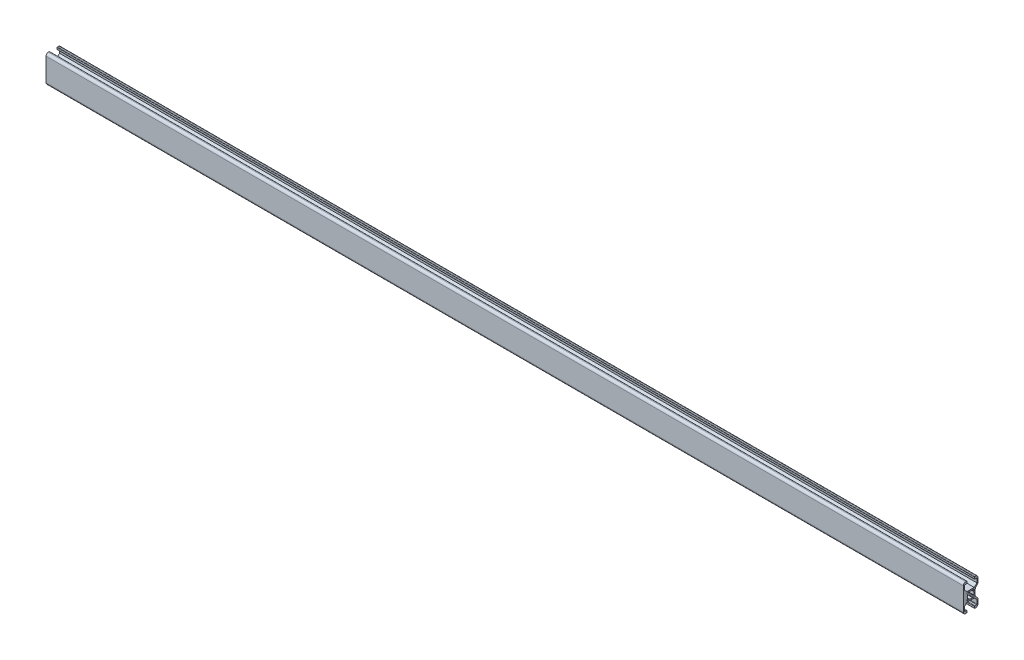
ISO-10303-21;
HEADER;
FILE_DESCRIPTION(('STEP AP214'),'2;1');
FILE_NAME('part.step','',(''),(''),'','','');
FILE_SCHEMA(('AUTOMOTIVE_DESIGN { 1 0 10303 214 1 1 1 1 }'));
ENDSEC;
DATA;
#1=APPLICATION_CONTEXT('core data for automotive mechanical design processes');
#2=APPLICATION_PROTOCOL_DEFINITION('international standard','automotive_design',2000,#1);
#3=PRODUCT_CONTEXT('',#1,'mechanical');
#4=PRODUCT('Part','Part','',(#3));
#5=PRODUCT_RELATED_PRODUCT_CATEGORY('part','',(#4));
#6=PRODUCT_DEFINITION_FORMATION('','',#4);
#7=PRODUCT_DEFINITION_CONTEXT('part definition',#1,'design');
#8=PRODUCT_DEFINITION('design','',#6,#7);
#9=PRODUCT_DEFINITION_SHAPE('','',#8);
#10=(LENGTH_UNIT() NAMED_UNIT(*) SI_UNIT(.MILLI.,.METRE.));
#11=(NAMED_UNIT(*) PLANE_ANGLE_UNIT() SI_UNIT($,.RADIAN.));
#12=(NAMED_UNIT(*) SI_UNIT($,.STERADIAN.) SOLID_ANGLE_UNIT());
#13=UNCERTAINTY_MEASURE_WITH_UNIT(LENGTH_MEASURE(1.E-05),#10,'distance_accuracy_value','');
#14=(GEOMETRIC_REPRESENTATION_CONTEXT(3) GLOBAL_UNCERTAINTY_ASSIGNED_CONTEXT((#13)) GLOBAL_UNIT_ASSIGNED_CONTEXT((#10,
#11,#12)) REPRESENTATION_CONTEXT('',''));
#15=CARTESIAN_POINT('',(0.,0.,0.));
#16=DIRECTION('',(0.,0.,1.));
#17=DIRECTION('',(1.,0.,0.));
#18=AXIS2_PLACEMENT_3D('',#15,#16,#17);
#19=CARTESIAN_POINT('',(1000.,-12.2000082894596,6.50000238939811));
#20=DIRECTION('',(-1.,0.,0.));
#21=DIRECTION('',(0.,0.,1.));
#22=AXIS2_PLACEMENT_3D('',#19,#20,#21);
#23=CYLINDRICAL_SURFACE('',#22,0.299997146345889);
#24=CARTESIAN_POINT('',(0.,-12.2000082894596,6.50000238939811));
#25=DIRECTION('',(-1.,0.,0.));
#26=DIRECTION('',(0.,0.,-1.));
#27=AXIS2_PLACEMENT_3D('',#24,#25,#26);
#28=CIRCLE('',#27,0.299997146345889);
#29=CARTESIAN_POINT('',(0.,-12.5000054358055,6.50000238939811));
#30=VERTEX_POINT('',#29);
#31=CARTESIAN_POINT('',(0.,-12.2000082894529,6.799999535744));
#32=VERTEX_POINT('',#31);
#33=EDGE_CURVE('E860',#30,#32,#28,.T.);
#34=ORIENTED_EDGE('',*,*,#33,.T.);
#35=DIRECTION('',(-1.,0.,0.));
#36=VECTOR('',#35,1.);
#37=CARTESIAN_POINT('',(1000.,-12.2000082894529,6.799999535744));
#38=LINE('',#37,#36);
#39=CARTESIAN_POINT('',(1000.,-12.2000082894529,6.799999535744));
#40=VERTEX_POINT('',#39);
#41=EDGE_CURVE('E13',#40,#32,#38,.T.);
#42=ORIENTED_EDGE('',*,*,#41,.F.);
#43=CARTESIAN_POINT('',(1000.,-12.2000082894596,6.50000238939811));
#44=DIRECTION('',(-1.,0.,0.));
#45=DIRECTION('',(0.,0.,-1.));
#46=AXIS2_PLACEMENT_3D('',#43,#44,#45);
#47=CIRCLE('',#46,0.299997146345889);
#48=CARTESIAN_POINT('',(1000.,-12.5000054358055,6.50000238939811));
#49=VERTEX_POINT('',#48);
#50=EDGE_CURVE('E1414',#49,#40,#47,.T.);
#51=ORIENTED_EDGE('',*,*,#50,.F.);
#52=DIRECTION('',(-1.,0.,0.));
#53=VECTOR('',#52,1.);
#54=CARTESIAN_POINT('',(1000.,-12.5000054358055,6.50000238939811));
#55=LINE('',#54,#53);
#56=EDGE_CURVE('E1003',#49,#30,#55,.T.);
#57=ORIENTED_EDGE('',*,*,#56,.T.);
#58=EDGE_LOOP('',(#34,#42,#51,#57));
#59=FACE_BOUND('',#58,.T.);
#60=ADVANCED_FACE('F195',(#59),#23,.F.);
#61=CARTESIAN_POINT('',(1000.,-12.2000082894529,6.799999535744));
#62=DIRECTION('',(0.,0.,1.));
#63=DIRECTION('',(0.,-1.,0.));
#64=AXIS2_PLACEMENT_3D('',#61,#62,#63);
#65=PLANE('',#64);
#66=DIRECTION('',(0.,1.,0.));
#67=VECTOR('',#66,1.);
#68=CARTESIAN_POINT('',(0.,-12.2000082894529,6.799999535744));
#69=LINE('',#68,#67);
#70=CARTESIAN_POINT('',(0.,-7.8606591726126,6.79999953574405));
#71=VERTEX_POINT('',#70);
#72=EDGE_CURVE('E864',#32,#71,#69,.T.);
#73=ORIENTED_EDGE('',*,*,#72,.T.);
#74=DIRECTION('',(-1.,0.,0.));
#75=VECTOR('',#74,1.);
#76=CARTESIAN_POINT('',(1000.,-7.8606591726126,6.79999953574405));
#77=LINE('',#76,#75);
#78=CARTESIAN_POINT('',(1000.,-7.8606591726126,6.79999953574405));
#79=VERTEX_POINT('',#78);
#80=EDGE_CURVE('E206',#79,#71,#77,.T.);
#81=ORIENTED_EDGE('',*,*,#80,.F.);
#82=DIRECTION('',(0.,1.,0.));
#83=VECTOR('',#82,1.);
#84=CARTESIAN_POINT('',(1000.,-12.2000082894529,6.799999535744));
#85=LINE('',#84,#83);
#86=EDGE_CURVE('E1417',#40,#79,#85,.T.);
#87=ORIENTED_EDGE('',*,*,#86,.F.);
#88=ORIENTED_EDGE('',*,*,#41,.T.);
#89=EDGE_LOOP('',(#73,#81,#87,#88));
#90=FACE_BOUND('',#89,.T.);
#91=ADVANCED_FACE('F1576',(#90),#65,.F.);
#92=CARTESIAN_POINT('',(1000.,-7.8606591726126,6.79999953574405));
#93=DIRECTION('',(0.,0.707106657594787,0.707106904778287));
#94=DIRECTION('',(0.,-0.707106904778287,0.707106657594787));
#95=AXIS2_PLACEMENT_3D('',#92,#93,#94);
#96=PLANE('',#95);
#97=DIRECTION('',(0.,0.707106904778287,-0.707106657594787));
#98=VECTOR('',#97,1.);
#99=CARTESIAN_POINT('',(0.,-7.8606591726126,6.79999953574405));
#100=LINE('',#99,#98);
#101=CARTESIAN_POINT('',(0.,-5.00000177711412,3.93934314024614));
#102=VERTEX_POINT('',#101);
#103=EDGE_CURVE('E867',#71,#102,#100,.T.);
#104=ORIENTED_EDGE('',*,*,#103,.T.);
#105=DIRECTION('',(-1.,0.,0.));
#106=VECTOR('',#105,1.);
#107=CARTESIAN_POINT('',(1000.,-5.00000177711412,3.93934314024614));
#108=LINE('',#107,#106);
#109=CARTESIAN_POINT('',(1000.,-5.00000177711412,3.93934314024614));
#110=VERTEX_POINT('',#109);
#111=EDGE_CURVE('E1174',#110,#102,#108,.T.);
#112=ORIENTED_EDGE('',*,*,#111,.F.);
#113=DIRECTION('',(0.,0.707106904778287,-0.707106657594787));
#114=VECTOR('',#113,1.);
#115=CARTESIAN_POINT('',(1000.,-7.8606591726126,6.79999953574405));
#116=LINE('',#115,#114);
#117=EDGE_CURVE('E1420',#79,#110,#116,.T.);
#118=ORIENTED_EDGE('',*,*,#117,.F.);
#119=ORIENTED_EDGE('',*,*,#80,.T.);
#120=EDGE_LOOP('',(#104,#112,#118,#119));
#121=FACE_BOUND('',#120,.T.);
#122=ADVANCED_FACE('F1581',(#121),#96,.F.);
#123=CARTESIAN_POINT('',(1000.,-5.00000177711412,3.93934314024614));
#124=DIRECTION('',(0.,1.,0.));
#125=DIRECTION('',(0.,0.,1.));
#126=AXIS2_PLACEMENT_3D('',#123,#124,#125);
#127=PLANE('',#126);
#128=DIRECTION('',(0.,0.,-1.));
#129=VECTOR('',#128,1.);
#130=CARTESIAN_POINT('',(0.,-5.00000177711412,3.93934314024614));
#131=LINE('',#130,#129);
#132=CARTESIAN_POINT('',(0.,-5.00000177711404,-3.939340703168));
#133=VERTEX_POINT('',#132);
#134=EDGE_CURVE('E870',#102,#133,#131,.T.);
#135=ORIENTED_EDGE('',*,*,#134,.T.);
#136=DIRECTION('',(-1.,0.,0.));
#137=VECTOR('',#136,1.);
#138=CARTESIAN_POINT('',(1000.,-5.00000177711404,-3.939340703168));
#139=LINE('',#138,#137);
#140=CARTESIAN_POINT('',(1000.,-5.00000177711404,-3.939340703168));
#141=VERTEX_POINT('',#140);
#142=EDGE_CURVE('E1170',#141,#133,#139,.T.);
#143=ORIENTED_EDGE('',*,*,#142,.F.);
#144=DIRECTION('',(0.,0.,-1.));
#145=VECTOR('',#144,1.);
#146=CARTESIAN_POINT('',(1000.,-5.00000177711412,3.93934314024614));
#147=LINE('',#146,#145);
#148=EDGE_CURVE('E1423',#110,#141,#147,.T.);
#149=ORIENTED_EDGE('',*,*,#148,.F.);
#150=ORIENTED_EDGE('',*,*,#111,.T.);
#151=EDGE_LOOP('',(#135,#143,#149,#150));
#152=FACE_BOUND('',#151,.T.);
#153=ADVANCED_FACE('F1867',(#152),#127,.F.);
#154=CARTESIAN_POINT('',(1000.,-5.00000177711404,-3.939340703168));
#155=DIRECTION('',(0.,0.707106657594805,-0.707106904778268));
#156=DIRECTION('',(0.,0.707106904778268,0.707106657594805));
#157=AXIS2_PLACEMENT_3D('',#154,#155,#156);
#158=PLANE('',#157);
#159=DIRECTION('',(0.,-0.707106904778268,-0.707106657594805));
#160=VECTOR('',#159,1.);
#161=CARTESIAN_POINT('',(0.,-5.00000177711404,-3.939340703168));
#162=LINE('',#161,#160);
#163=CARTESIAN_POINT('',(0.,-7.86065917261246,-6.79999709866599));
#164=VERTEX_POINT('',#163);
#165=EDGE_CURVE('E873',#133,#164,#162,.T.);
#166=ORIENTED_EDGE('',*,*,#165,.T.);
#167=DIRECTION('',(-1.,0.,0.));
#168=VECTOR('',#167,1.);
#169=CARTESIAN_POINT('',(1000.,-7.86065917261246,-6.79999709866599));
#170=LINE('',#169,#168);
#171=CARTESIAN_POINT('',(1000.,-7.86065917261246,-6.79999709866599));
#172=VERTEX_POINT('',#171);
#173=EDGE_CURVE('E1166',#172,#164,#170,.T.);
#174=ORIENTED_EDGE('',*,*,#173,.F.);
#175=DIRECTION('',(0.,-0.707106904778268,-0.707106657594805));
#176=VECTOR('',#175,1.);
#177=CARTESIAN_POINT('',(1000.,-5.00000177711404,-3.939340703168));
#178=LINE('',#177,#176);
#179=EDGE_CURVE('E1426',#141,#172,#178,.T.);
#180=ORIENTED_EDGE('',*,*,#179,.F.);
#181=ORIENTED_EDGE('',*,*,#142,.T.);
#182=EDGE_LOOP('',(#166,#174,#180,#181));
#183=FACE_BOUND('',#182,.T.);
#184=ADVANCED_FACE('F1863',(#183),#158,.F.);
#185=CARTESIAN_POINT('',(1000.,-7.86065917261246,-6.79999709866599));
#186=DIRECTION('',(0.,0.,-1.));
#187=DIRECTION('',(0.,1.,0.));
#188=AXIS2_PLACEMENT_3D('',#185,#186,#187);
#189=PLANE('',#188);
#190=DIRECTION('',(0.,-1.,0.));
#191=VECTOR('',#190,1.);
#192=CARTESIAN_POINT('',(0.,-7.86065917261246,-6.79999709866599));
#193=LINE('',#192,#191);
#194=CARTESIAN_POINT('',(0.,-12.2000082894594,-6.79999709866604));
#195=VERTEX_POINT('',#194);
#196=EDGE_CURVE('E876',#164,#195,#193,.T.);
#197=ORIENTED_EDGE('',*,*,#196,.T.);
#198=DIRECTION('',(-1.,0.,0.));
#199=VECTOR('',#198,1.);
#200=CARTESIAN_POINT('',(1000.,-12.2000082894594,-6.79999709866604));
#201=LINE('',#200,#199);
#202=CARTESIAN_POINT('',(1000.,-12.2000082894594,-6.79999709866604));
#203=VERTEX_POINT('',#202);
#204=EDGE_CURVE('E1162',#203,#195,#201,.T.);
#205=ORIENTED_EDGE('',*,*,#204,.F.);
#206=DIRECTION('',(0.,-1.,0.));
#207=VECTOR('',#206,1.);
#208=CARTESIAN_POINT('',(1000.,-7.86065917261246,-6.79999709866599));
#209=LINE('',#208,#207);
#210=EDGE_CURVE('E1429',#172,#203,#209,.T.);
#211=ORIENTED_EDGE('',*,*,#210,.F.);
#212=ORIENTED_EDGE('',*,*,#173,.T.);
#213=EDGE_LOOP('',(#197,#205,#211,#212));
#214=FACE_BOUND('',#213,.T.);
#215=ADVANCED_FACE('F1859',(#214),#189,.F.);
#216=CARTESIAN_POINT('',(1000.,-12.200001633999,-6.4999999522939));
#217=DIRECTION('',(-1.,0.,0.));
#218=DIRECTION('',(0.,0.,1.));
#219=AXIS2_PLACEMENT_3D('',#216,#217,#218);
#220=CYLINDRICAL_SURFACE('',#219,0.299997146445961);
#221=CARTESIAN_POINT('',(0.,-12.200001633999,-6.4999999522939));
#222=DIRECTION('',(-1.,0.,0.));
#223=DIRECTION('',(0.,0.,-1.));
#224=AXIS2_PLACEMENT_3D('',#221,#222,#223);
#225=CIRCLE('',#224,0.299997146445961);
#226=CARTESIAN_POINT('',(0.,-12.4999987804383,-6.50000195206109));
#227=VERTEX_POINT('',#226);
#228=EDGE_CURVE('E879',#195,#227,#225,.T.);
#229=ORIENTED_EDGE('',*,*,#228,.T.);
#230=DIRECTION('',(-1.,0.,0.));
#231=VECTOR('',#230,1.);
#232=CARTESIAN_POINT('',(1000.,-12.4999987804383,-6.50000195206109));
#233=LINE('',#232,#231);
#234=CARTESIAN_POINT('',(1000.,-12.4999987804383,-6.50000195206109));
#235=VERTEX_POINT('',#234);
#236=EDGE_CURVE('E1158',#235,#227,#233,.T.);
#237=ORIENTED_EDGE('',*,*,#236,.F.);
#238=CARTESIAN_POINT('',(1000.,-12.200001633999,-6.4999999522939));
#239=DIRECTION('',(-1.,0.,0.));
#240=DIRECTION('',(0.,0.,-1.));
#241=AXIS2_PLACEMENT_3D('',#238,#239,#240);
#242=CIRCLE('',#241,0.299997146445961);
#243=EDGE_CURVE('E1432',#203,#235,#242,.T.);
#244=ORIENTED_EDGE('',*,*,#243,.F.);
#245=ORIENTED_EDGE('',*,*,#204,.T.);
#246=EDGE_LOOP('',(#229,#237,#244,#245));
#247=FACE_BOUND('',#246,.T.);
#248=ADVANCED_FACE('F1855',(#247),#220,.F.);
#249=CARTESIAN_POINT('',(1000.,-12.4999987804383,-6.50000195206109));
#250=DIRECTION('',(0.,-1.,0.));
#251=DIRECTION('',(0.,0.,-1.));
#252=AXIS2_PLACEMENT_3D('',#249,#250,#251);
#253=PLANE('',#252);
#254=DIRECTION('',(0.,0.,1.));
#255=VECTOR('',#254,1.);
#256=CARTESIAN_POINT('',(0.,-12.4999987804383,-6.50000195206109));
#257=LINE('',#256,#255);
#258=CARTESIAN_POINT('',(0.,-12.4999987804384,-4.59999902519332));
#259=VERTEX_POINT('',#258);
#260=EDGE_CURVE('E882',#227,#259,#257,.T.);
#261=ORIENTED_EDGE('',*,*,#260,.T.);
#262=DIRECTION('',(-1.,0.,0.));
#263=VECTOR('',#262,1.);
#264=CARTESIAN_POINT('',(1000.,-12.4999987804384,-4.59999902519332));
#265=LINE('',#264,#263);
#266=CARTESIAN_POINT('',(1000.,-12.4999987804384,-4.59999902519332));
#267=VERTEX_POINT('',#266);
#268=EDGE_CURVE('E1154',#267,#259,#265,.T.);
#269=ORIENTED_EDGE('',*,*,#268,.F.);
#270=DIRECTION('',(0.,0.,1.));
#271=VECTOR('',#270,1.);
#272=CARTESIAN_POINT('',(1000.,-12.4999987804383,-6.50000195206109));
#273=LINE('',#272,#271);
#274=EDGE_CURVE('E1435',#235,#267,#273,.T.);
#275=ORIENTED_EDGE('',*,*,#274,.F.);
#276=ORIENTED_EDGE('',*,*,#236,.T.);
#277=EDGE_LOOP('',(#261,#269,#275,#276));
#278=FACE_BOUND('',#277,.T.);
#279=ADVANCED_FACE('F1851',(#278),#253,.F.);
#280=CARTESIAN_POINT('',(1000.,-12.9999990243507,-4.59999902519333));
#281=DIRECTION('',(-1.,0.,0.));
#282=DIRECTION('',(0.,0.,1.));
#283=AXIS2_PLACEMENT_3D('',#280,#281,#282);
#284=CYLINDRICAL_SURFACE('',#283,0.500000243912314);
#285=CARTESIAN_POINT('',(0.,-12.9999990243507,-4.59999902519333));
#286=DIRECTION('',(1.,0.,0.));
#287=DIRECTION('',(0.,0.,-1.));
#288=AXIS2_PLACEMENT_3D('',#285,#286,#287);
#289=CIRCLE('',#288,0.500000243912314);
#290=CARTESIAN_POINT('',(0.,-12.9999990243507,-4.09999878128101));
#291=VERTEX_POINT('',#290);
#292=EDGE_CURVE('E885',#259,#291,#289,.T.);
#293=ORIENTED_EDGE('',*,*,#292,.T.);
#294=DIRECTION('',(-1.,0.,0.));
#295=VECTOR('',#294,1.);
#296=CARTESIAN_POINT('',(1000.,-12.9999990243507,-4.09999878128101));
#297=LINE('',#296,#295);
#298=CARTESIAN_POINT('',(1000.,-12.9999990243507,-4.09999878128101));
#299=VERTEX_POINT('',#298);
#300=EDGE_CURVE('E1150',#299,#291,#297,.T.);
#301=ORIENTED_EDGE('',*,*,#300,.F.);
#302=CARTESIAN_POINT('',(1000.,-12.9999990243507,-4.59999902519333));
#303=DIRECTION('',(1.,0.,0.));
#304=DIRECTION('',(0.,0.,-1.));
#305=AXIS2_PLACEMENT_3D('',#302,#303,#304);
#306=CIRCLE('',#305,0.500000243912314);
#307=EDGE_CURVE('E1438',#267,#299,#306,.T.);
#308=ORIENTED_EDGE('',*,*,#307,.F.);
#309=ORIENTED_EDGE('',*,*,#268,.T.);
#310=EDGE_LOOP('',(#293,#301,#308,#309));
#311=FACE_BOUND('',#310,.T.);
#312=ADVANCED_FACE('F1847',(#311),#284,.T.);
#313=CARTESIAN_POINT('',(1000.,-12.9999990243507,-4.09999878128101));
#314=DIRECTION('',(0.,0.,-1.));
#315=DIRECTION('',(0.,1.,0.));
#316=AXIS2_PLACEMENT_3D('',#313,#314,#315);
#317=PLANE('',#316);
#318=DIRECTION('',(0.,-1.,0.));
#319=VECTOR('',#318,1.);
#320=CARTESIAN_POINT('',(0.,-12.9999990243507,-4.09999878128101));
#321=LINE('',#320,#319);
#322=CARTESIAN_POINT('',(0.,-14.6999998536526,-4.09999878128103));
#323=VERTEX_POINT('',#322);
#324=EDGE_CURVE('E888',#291,#323,#321,.T.);
#325=ORIENTED_EDGE('',*,*,#324,.T.);
#326=DIRECTION('',(-1.,0.,0.));
#327=VECTOR('',#326,1.);
#328=CARTESIAN_POINT('',(1000.,-14.6999998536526,-4.09999878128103));
#329=LINE('',#328,#327);
#330=CARTESIAN_POINT('',(1000.,-14.6999998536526,-4.09999878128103));
#331=VERTEX_POINT('',#330);
#332=EDGE_CURVE('E1146',#331,#323,#329,.T.);
#333=ORIENTED_EDGE('',*,*,#332,.F.);
#334=DIRECTION('',(0.,-1.,0.));
#335=VECTOR('',#334,1.);
#336=CARTESIAN_POINT('',(1000.,-12.9999990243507,-4.09999878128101));
#337=LINE('',#336,#335);
#338=EDGE_CURVE('E1441',#299,#331,#337,.T.);
#339=ORIENTED_EDGE('',*,*,#338,.F.);
#340=ORIENTED_EDGE('',*,*,#300,.T.);
#341=EDGE_LOOP('',(#325,#333,#339,#340));
#342=FACE_BOUND('',#341,.T.);
#343=ADVANCED_FACE('F1843',(#342),#317,.F.);
#344=CARTESIAN_POINT('',(1000.,-14.6999998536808,-4.3999989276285));
#345=DIRECTION('',(-1.,0.,0.));
#346=DIRECTION('',(0.,0.,1.));
#347=AXIS2_PLACEMENT_3D('',#344,#345,#346);
#348=CYLINDRICAL_SURFACE('',#347,0.30000014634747);
#349=CARTESIAN_POINT('',(0.,-14.6999998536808,-4.3999989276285));
#350=DIRECTION('',(1.,0.,0.));
#351=DIRECTION('',(0.,0.,-1.));
#352=AXIS2_PLACEMENT_3D('',#349,#350,#351);
#353=CIRCLE('',#352,0.30000014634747);
#354=CARTESIAN_POINT('',(0.,-15.,-4.39999480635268));
#355=VERTEX_POINT('',#354);
#356=EDGE_CURVE('E891',#323,#355,#353,.T.);
#357=ORIENTED_EDGE('',*,*,#356,.T.);
#358=DIRECTION('',(-1.,0.,0.));
#359=VECTOR('',#358,1.);
#360=CARTESIAN_POINT('',(1000.,-15.,-4.39999480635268));
#361=LINE('',#360,#359);
#362=CARTESIAN_POINT('',(1000.,-15.,-4.39999480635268));
#363=VERTEX_POINT('',#362);
#364=EDGE_CURVE('E1142',#363,#355,#361,.T.);
#365=ORIENTED_EDGE('',*,*,#364,.F.);
#366=CARTESIAN_POINT('',(1000.,-14.6999998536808,-4.3999989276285));
#367=DIRECTION('',(1.,0.,0.));
#368=DIRECTION('',(0.,0.,-1.));
#369=AXIS2_PLACEMENT_3D('',#366,#367,#368);
#370=CIRCLE('',#369,0.30000014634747);
#371=EDGE_CURVE('E1444',#331,#363,#370,.T.);
#372=ORIENTED_EDGE('',*,*,#371,.F.);
#373=ORIENTED_EDGE('',*,*,#332,.T.);
#374=EDGE_LOOP('',(#357,#365,#372,#373));
#375=FACE_BOUND('',#374,.T.);
#376=ADVANCED_FACE('F1839',(#375),#348,.T.);
#377=CARTESIAN_POINT('',(1000.,-15.,-4.39999480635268));
#378=DIRECTION('',(0.,1.,0.));
#379=DIRECTION('',(0.,0.,1.));
#380=AXIS2_PLACEMENT_3D('',#377,#378,#379);
#381=PLANE('',#380);
#382=DIRECTION('',(0.,0.,-1.));
#383=VECTOR('',#382,1.);
#384=CARTESIAN_POINT('',(0.,-15.,-4.39999480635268));
#385=LINE('',#384,#383);
#386=CARTESIAN_POINT('',(0.,-14.9999999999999,-5.49999634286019));
#387=VERTEX_POINT('',#386);
#388=EDGE_CURVE('E894',#355,#387,#385,.T.);
#389=ORIENTED_EDGE('',*,*,#388,.T.);
#390=DIRECTION('',(-1.,0.,0.));
#391=VECTOR('',#390,1.);
#392=CARTESIAN_POINT('',(1000.,-14.9999999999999,-5.49999634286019));
#393=LINE('',#392,#391);
#394=CARTESIAN_POINT('',(1000.,-14.9999999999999,-5.49999634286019));
#395=VERTEX_POINT('',#394);
#396=EDGE_CURVE('E1138',#395,#387,#393,.T.);
#397=ORIENTED_EDGE('',*,*,#396,.F.);
#398=DIRECTION('',(0.,0.,-1.));
#399=VECTOR('',#398,1.);
#400=CARTESIAN_POINT('',(1000.,-15.,-4.39999480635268));
#401=LINE('',#400,#399);
#402=EDGE_CURVE('E1447',#363,#395,#401,.T.);
#403=ORIENTED_EDGE('',*,*,#402,.F.);
#404=ORIENTED_EDGE('',*,*,#364,.T.);
#405=EDGE_LOOP('',(#389,#397,#403,#404));
#406=FACE_BOUND('',#405,.T.);
#407=ADVANCED_FACE('F1835',(#406),#381,.F.);
#408=CARTESIAN_POINT('',(1000.,-12.499998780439,-5.49999465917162));
#409=DIRECTION('',(-1.,0.,0.));
#410=DIRECTION('',(0.,0.,1.));
#411=AXIS2_PLACEMENT_3D('',#408,#409,#410);
#412=CYLINDRICAL_SURFACE('',#411,2.50000121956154);
#413=CARTESIAN_POINT('',(0.,-12.499998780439,-5.49999465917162));
#414=DIRECTION('',(1.,0.,0.));
#415=DIRECTION('',(0.,0.,-1.));
#416=AXIS2_PLACEMENT_3D('',#413,#414,#415);
#417=CIRCLE('',#416,2.50000121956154);
#418=CARTESIAN_POINT('',(0.,-12.5000054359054,-7.9999958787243));
#419=VERTEX_POINT('',#418);
#420=EDGE_CURVE('E897',#387,#419,#417,.T.);
#421=ORIENTED_EDGE('',*,*,#420,.T.);
#422=DIRECTION('',(-1.,0.,0.));
#423=VECTOR('',#422,1.);
#424=CARTESIAN_POINT('',(1000.,-12.5000054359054,-7.9999958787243));
#425=LINE('',#424,#423);
#426=CARTESIAN_POINT('',(1000.,-12.5000054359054,-7.9999958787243));
#427=VERTEX_POINT('',#426);
#428=EDGE_CURVE('E1134',#427,#419,#425,.T.);
#429=ORIENTED_EDGE('',*,*,#428,.F.);
#430=CARTESIAN_POINT('',(1000.,-12.499998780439,-5.49999465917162));
#431=DIRECTION('',(1.,0.,0.));
#432=DIRECTION('',(0.,0.,-1.));
#433=AXIS2_PLACEMENT_3D('',#430,#431,#432);
#434=CIRCLE('',#433,2.50000121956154);
#435=EDGE_CURVE('E1450',#395,#427,#434,.T.);
#436=ORIENTED_EDGE('',*,*,#435,.F.);
#437=ORIENTED_EDGE('',*,*,#396,.T.);
#438=EDGE_LOOP('',(#421,#429,#436,#437));
#439=FACE_BOUND('',#438,.T.);
#440=ADVANCED_FACE('F1831',(#439),#412,.T.);
#441=CARTESIAN_POINT('',(1000.,-12.5000054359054,-7.9999958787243));
#442=DIRECTION('',(0.,0.,1.));
#443=DIRECTION('',(0.,-1.,0.));
#444=AXIS2_PLACEMENT_3D('',#441,#442,#443);
#445=PLANE('',#444);
#446=DIRECTION('',(0.,1.,0.));
#447=VECTOR('',#446,1.);
#448=CARTESIAN_POINT('',(0.,-12.5000054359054,-7.9999958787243));
#449=LINE('',#448,#447);
#450=CARTESIAN_POINT('',(0.,-7.97487722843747,-7.99999587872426));
#451=VERTEX_POINT('',#450);
#452=EDGE_CURVE('E900',#419,#451,#449,.T.);
#453=ORIENTED_EDGE('',*,*,#452,.T.);
#454=DIRECTION('',(-1.,0.,0.));
#455=VECTOR('',#454,1.);
#456=CARTESIAN_POINT('',(1000.,-7.97487722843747,-7.99999587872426));
#457=LINE('',#456,#455);
#458=CARTESIAN_POINT('',(1000.,-7.97487722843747,-7.99999587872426));
#459=VERTEX_POINT('',#458);
#460=EDGE_CURVE('E1130',#459,#451,#457,.T.);
#461=ORIENTED_EDGE('',*,*,#460,.F.);
#462=DIRECTION('',(0.,1.,0.));
#463=VECTOR('',#462,1.);
#464=CARTESIAN_POINT('',(1000.,-12.5000054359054,-7.9999958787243));
#465=LINE('',#464,#463);
#466=EDGE_CURVE('E1453',#427,#459,#465,.T.);
#467=ORIENTED_EDGE('',*,*,#466,.F.);
#468=ORIENTED_EDGE('',*,*,#428,.T.);
#469=EDGE_LOOP('',(#453,#461,#467,#468));
#470=FACE_BOUND('',#469,.T.);
#471=ADVANCED_FACE('F1827',(#470),#445,.F.);
#472=CARTESIAN_POINT('',(1000.,-7.97487722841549,-5.4999945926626));
#473=DIRECTION('',(-1.,0.,0.));
#474=DIRECTION('',(0.,0.,1.));
#475=AXIS2_PLACEMENT_3D('',#472,#473,#474);
#476=CYLINDRICAL_SURFACE('',#475,2.50000128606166);
#477=CARTESIAN_POINT('',(0.,-7.97487722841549,-5.4999945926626));
#478=DIRECTION('',(1.,0.,0.));
#479=DIRECTION('',(0.,0.,-1.));
#480=AXIS2_PLACEMENT_3D('',#477,#478,#479);
#481=CIRCLE('',#480,2.50000128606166);
#482=CARTESIAN_POINT('',(0.,-6.20710936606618,-7.26776245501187));
#483=VERTEX_POINT('',#482);
#484=EDGE_CURVE('E903',#451,#483,#481,.T.);
#485=ORIENTED_EDGE('',*,*,#484,.T.);
#486=DIRECTION('',(-1.,0.,0.));
#487=VECTOR('',#486,1.);
#488=CARTESIAN_POINT('',(1000.,-6.20710936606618,-7.26776245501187));
#489=LINE('',#488,#487);
#490=CARTESIAN_POINT('',(1000.,-6.20710936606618,-7.26776245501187));
#491=VERTEX_POINT('',#490);
#492=EDGE_CURVE('E1126',#491,#483,#489,.T.);
#493=ORIENTED_EDGE('',*,*,#492,.F.);
#494=CARTESIAN_POINT('',(1000.,-7.97487722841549,-5.4999945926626));
#495=DIRECTION('',(1.,0.,0.));
#496=DIRECTION('',(0.,0.,-1.));
#497=AXIS2_PLACEMENT_3D('',#494,#495,#496);
#498=CIRCLE('',#497,2.50000128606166);
#499=EDGE_CURVE('E1456',#459,#491,#498,.T.);
#500=ORIENTED_EDGE('',*,*,#499,.F.);
#501=ORIENTED_EDGE('',*,*,#460,.T.);
#502=EDGE_LOOP('',(#485,#493,#500,#501));
#503=FACE_BOUND('',#502,.T.);
#504=ADVANCED_FACE('F1823',(#503),#476,.T.);
#505=CARTESIAN_POINT('',(1000.,-6.20710936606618,-7.26776245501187));
#506=DIRECTION('',(0.,-0.707106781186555,0.707106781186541));
#507=DIRECTION('',(0.,-0.707106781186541,-0.707106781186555));
#508=AXIS2_PLACEMENT_3D('',#505,#506,#507);
#509=PLANE('',#508);
#510=DIRECTION('',(0.,0.707106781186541,0.707106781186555));
#511=VECTOR('',#510,1.);
#512=CARTESIAN_POINT('',(0.,-6.20710936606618,-7.26776245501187));
#513=LINE('',#512,#511);
#514=CARTESIAN_POINT('',(0.,-4.67157461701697,-5.73222770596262));
#515=VERTEX_POINT('',#514);
#516=EDGE_CURVE('E906',#483,#515,#513,.T.);
#517=ORIENTED_EDGE('',*,*,#516,.T.);
#518=DIRECTION('',(-1.,0.,0.));
#519=VECTOR('',#518,1.);
#520=CARTESIAN_POINT('',(1000.,-4.67157461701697,-5.73222770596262));
#521=LINE('',#520,#519);
#522=CARTESIAN_POINT('',(1000.,-4.67157461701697,-5.73222770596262));
#523=VERTEX_POINT('',#522);
#524=EDGE_CURVE('E1122',#523,#515,#521,.T.);
#525=ORIENTED_EDGE('',*,*,#524,.F.);
#526=DIRECTION('',(0.,0.707106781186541,0.707106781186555));
#527=VECTOR('',#526,1.);
#528=CARTESIAN_POINT('',(1000.,-6.20710936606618,-7.26776245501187));
#529=LINE('',#528,#527);
#530=EDGE_CURVE('E1459',#491,#523,#529,.T.);
#531=ORIENTED_EDGE('',*,*,#530,.F.);
#532=ORIENTED_EDGE('',*,*,#492,.T.);
#533=EDGE_LOOP('',(#517,#525,#531,#532));
#534=FACE_BOUND('',#533,.T.);
#535=ADVANCED_FACE('F1819',(#534),#509,.F.);
#536=CARTESIAN_POINT('',(1000.,-2.90380835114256,-7.49999716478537));
#537=DIRECTION('',(-1.,0.,0.));
#538=DIRECTION('',(0.,0.,1.));
#539=AXIS2_PLACEMENT_3D('',#536,#537,#538);
#540=CYLINDRICAL_SURFACE('',#539,2.50000128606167);
#541=CARTESIAN_POINT('',(0.,-2.90380835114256,-7.49999716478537));
#542=DIRECTION('',(-1.,0.,0.));
#543=DIRECTION('',(0.,0.,-1.));
#544=AXIS2_PLACEMENT_3D('',#541,#542,#543);
#545=CIRCLE('',#544,2.50000128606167);
#546=CARTESIAN_POINT('',(0.,-2.90380675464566,-4.99999587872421));
#547=VERTEX_POINT('',#546);
#548=EDGE_CURVE('E909',#515,#547,#545,.T.);
#549=ORIENTED_EDGE('',*,*,#548,.T.);
#550=DIRECTION('',(-1.,0.,0.));
#551=VECTOR('',#550,1.);
#552=CARTESIAN_POINT('',(1000.,-2.90380675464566,-4.99999587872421));
#553=LINE('',#552,#551);
#554=CARTESIAN_POINT('',(1000.,-2.90380675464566,-4.99999587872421));
#555=VERTEX_POINT('',#554);
#556=EDGE_CURVE('E1118',#555,#547,#553,.T.);
#557=ORIENTED_EDGE('',*,*,#556,.F.);
#558=CARTESIAN_POINT('',(1000.,-2.90380835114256,-7.49999716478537));
#559=DIRECTION('',(-1.,0.,0.));
#560=DIRECTION('',(0.,0.,-1.));
#561=AXIS2_PLACEMENT_3D('',#558,#559,#560);
#562=CIRCLE('',#561,2.50000128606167);
#563=EDGE_CURVE('E1462',#523,#555,#562,.T.);
#564=ORIENTED_EDGE('',*,*,#563,.F.);
#565=ORIENTED_EDGE('',*,*,#524,.T.);
#566=EDGE_LOOP('',(#549,#557,#564,#565));
#567=FACE_BOUND('',#566,.T.);
#568=ADVANCED_FACE('F1815',(#567),#540,.F.);
#569=CARTESIAN_POINT('',(1000.,-2.90380675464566,-4.99999587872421));
#570=DIRECTION('',(0.,0.,1.));
#571=DIRECTION('',(0.,-1.,0.));
#572=AXIS2_PLACEMENT_3D('',#569,#570,#571);
#573=PLANE('',#572);
#574=DIRECTION('',(0.,1.,0.));
#575=VECTOR('',#574,1.);
#576=CARTESIAN_POINT('',(0.,-2.90380675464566,-4.99999587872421));
#577=LINE('',#576,#575);
#578=CARTESIAN_POINT('',(0.,2.9038081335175,-4.99999587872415));
#579=VERTEX_POINT('',#578);
#580=EDGE_CURVE('E912',#547,#579,#577,.T.);
#581=ORIENTED_EDGE('',*,*,#580,.T.);
#582=DIRECTION('',(-1.,0.,0.));
#583=VECTOR('',#582,1.);
#584=CARTESIAN_POINT('',(1000.,2.9038081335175,-4.99999587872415));
#585=LINE('',#584,#583);
#586=CARTESIAN_POINT('',(1000.,2.9038081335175,-4.99999587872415));
#587=VERTEX_POINT('',#586);
#588=EDGE_CURVE('E1114',#587,#579,#585,.T.);
#589=ORIENTED_EDGE('',*,*,#588,.F.);
#590=DIRECTION('',(0.,1.,0.));
#591=VECTOR('',#590,1.);
#592=CARTESIAN_POINT('',(1000.,-2.90380675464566,-4.99999587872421));
#593=LINE('',#592,#591);
#594=EDGE_CURVE('E1465',#555,#587,#593,.T.);
#595=ORIENTED_EDGE('',*,*,#594,.F.);
#596=ORIENTED_EDGE('',*,*,#556,.T.);
#597=EDGE_LOOP('',(#581,#589,#595,#596));
#598=FACE_BOUND('',#597,.T.);
#599=ADVANCED_FACE('F1811',(#598),#573,.F.);
#600=CARTESIAN_POINT('',(1000.,2.90381638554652,-7.4999970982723));
#601=DIRECTION('',(-1.,0.,0.));
#602=DIRECTION('',(0.,0.,1.));
#603=AXIS2_PLACEMENT_3D('',#600,#601,#602);
#604=CYLINDRICAL_SURFACE('',#603,2.50000121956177);
#605=CARTESIAN_POINT('',(0.,2.90381638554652,-7.4999970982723));
#606=DIRECTION('',(-1.,0.,0.));
#607=DIRECTION('',(0.,0.,-1.));
#608=AXIS2_PLACEMENT_3D('',#605,#606,#607);
#609=CIRCLE('',#608,2.50000121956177);
#610=CARTESIAN_POINT('',(0.,4.67158260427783,-5.73222768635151));
#611=VERTEX_POINT('',#610);
#612=EDGE_CURVE('E915',#579,#611,#609,.T.);
#613=ORIENTED_EDGE('',*,*,#612,.T.);
#614=DIRECTION('',(-1.,0.,0.));
#615=VECTOR('',#614,1.);
#616=CARTESIAN_POINT('',(1000.,4.67158260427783,-5.73222768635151));
#617=LINE('',#616,#615);
#618=CARTESIAN_POINT('',(1000.,4.67158260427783,-5.73222768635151));
#619=VERTEX_POINT('',#618);
#620=EDGE_CURVE('E1110',#619,#611,#617,.T.);
#621=ORIENTED_EDGE('',*,*,#620,.F.);
#622=CARTESIAN_POINT('',(1000.,2.90381638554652,-7.4999970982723));
#623=DIRECTION('',(-1.,0.,0.));
#624=DIRECTION('',(0.,0.,-1.));
#625=AXIS2_PLACEMENT_3D('',#622,#623,#624);
#626=CIRCLE('',#625,2.50000121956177);
#627=EDGE_CURVE('E1468',#587,#619,#626,.T.);
#628=ORIENTED_EDGE('',*,*,#627,.F.);
#629=ORIENTED_EDGE('',*,*,#588,.T.);
#630=EDGE_LOOP('',(#613,#621,#628,#629));
#631=FACE_BOUND('',#630,.T.);
#632=ADVANCED_FACE('F1807',(#631),#604,.F.);
#633=CARTESIAN_POINT('',(1000.,4.67158260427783,-5.73222768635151));
#634=DIRECTION('',(0.,0.70710678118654,0.707106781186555));
#635=DIRECTION('',(0.,-0.707106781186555,0.70710678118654));
#636=AXIS2_PLACEMENT_3D('',#633,#634,#635);
#637=PLANE('',#636);
#638=DIRECTION('',(0.,0.707106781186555,-0.70710678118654));
#639=VECTOR('',#638,1.);
#640=CARTESIAN_POINT('',(0.,4.67158260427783,-5.73222768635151));
#641=LINE('',#640,#639);
#642=CARTESIAN_POINT('',(0.,6.2071178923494,-7.26776297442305));
#643=VERTEX_POINT('',#642);
#644=EDGE_CURVE('E918',#611,#643,#641,.T.);
#645=ORIENTED_EDGE('',*,*,#644,.T.);
#646=DIRECTION('',(-1.,0.,0.));
#647=VECTOR('',#646,1.);
#648=CARTESIAN_POINT('',(1000.,6.2071178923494,-7.26776297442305));
#649=LINE('',#648,#647);
#650=CARTESIAN_POINT('',(1000.,6.2071178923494,-7.26776297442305));
#651=VERTEX_POINT('',#650);
#652=EDGE_CURVE('E1106',#651,#643,#649,.T.);
#653=ORIENTED_EDGE('',*,*,#652,.F.);
#654=DIRECTION('',(0.,0.707106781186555,-0.70710678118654));
#655=VECTOR('',#654,1.);
#656=CARTESIAN_POINT('',(1000.,4.67158260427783,-5.73222768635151));
#657=LINE('',#656,#655);
#658=EDGE_CURVE('E1471',#619,#651,#657,.T.);
#659=ORIENTED_EDGE('',*,*,#658,.F.);
#660=ORIENTED_EDGE('',*,*,#620,.T.);
#661=EDGE_LOOP('',(#645,#653,#659,#660));
#662=FACE_BOUND('',#661,.T.);
#663=ADVANCED_FACE('F1803',(#662),#637,.F.);
#664=CARTESIAN_POINT('',(1000.,7.97488520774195,-5.49999465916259));
#665=DIRECTION('',(-1.,0.,0.));
#666=DIRECTION('',(0.,0.,1.));
#667=AXIS2_PLACEMENT_3D('',#664,#665,#666);
#668=CYLINDRICAL_SURFACE('',#667,2.5000012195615);
#669=CARTESIAN_POINT('',(0.,7.97488520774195,-5.49999465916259));
#670=DIRECTION('',(1.,0.,0.));
#671=DIRECTION('',(0.,0.,-1.));
#672=AXIS2_PLACEMENT_3D('',#669,#670,#671);
#673=CIRCLE('',#672,2.5000012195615);
#674=CARTESIAN_POINT('',(0.,7.97488520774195,-7.99999587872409));
#675=VERTEX_POINT('',#674);
#676=EDGE_CURVE('E921',#643,#675,#673,.T.);
#677=ORIENTED_EDGE('',*,*,#676,.T.);
#678=DIRECTION('',(-1.,0.,0.));
#679=VECTOR('',#678,1.);
#680=CARTESIAN_POINT('',(1000.,7.97488520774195,-7.99999587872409));
#681=LINE('',#680,#679);
#682=CARTESIAN_POINT('',(1000.,7.97488520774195,-7.99999587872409));
#683=VERTEX_POINT('',#682);
#684=EDGE_CURVE('E1102',#683,#675,#681,.T.);
#685=ORIENTED_EDGE('',*,*,#684,.F.);
#686=CARTESIAN_POINT('',(1000.,7.97488520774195,-5.49999465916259));
#687=DIRECTION('',(1.,0.,0.));
#688=DIRECTION('',(0.,0.,-1.));
#689=AXIS2_PLACEMENT_3D('',#686,#687,#688);
#690=CIRCLE('',#689,2.5000012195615);
#691=EDGE_CURVE('E1474',#651,#683,#690,.T.);
#692=ORIENTED_EDGE('',*,*,#691,.F.);
#693=ORIENTED_EDGE('',*,*,#652,.T.);
#694=EDGE_LOOP('',(#677,#685,#692,#693));
#695=FACE_BOUND('',#694,.T.);
#696=ADVANCED_FACE('F1799',(#695),#668,.T.);
#697=CARTESIAN_POINT('',(1000.,7.97488520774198,-7.99999587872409));
#698=DIRECTION('',(0.,0.,1.));
#699=DIRECTION('',(0.,-1.,0.));
#700=AXIS2_PLACEMENT_3D('',#697,#698,#699);
#701=PLANE('',#700);
#702=DIRECTION('',(0.,1.,0.));
#703=VECTOR('',#702,1.);
#704=CARTESIAN_POINT('',(0.,7.97488520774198,-7.99999587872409));
#705=LINE('',#704,#703);
#706=CARTESIAN_POINT('',(0.,12.5000134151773,-7.99999587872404));
#707=VERTEX_POINT('',#706);
#708=EDGE_CURVE('E924',#675,#707,#705,.T.);
#709=ORIENTED_EDGE('',*,*,#708,.T.);
#710=DIRECTION('',(-1.,0.,0.));
#711=VECTOR('',#710,1.);
#712=CARTESIAN_POINT('',(1000.,12.5000134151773,-7.99999587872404));
#713=LINE('',#712,#711);
#714=CARTESIAN_POINT('',(1000.,12.5000134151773,-7.99999587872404));
#715=VERTEX_POINT('',#714);
#716=EDGE_CURVE('E1098',#715,#707,#713,.T.);
#717=ORIENTED_EDGE('',*,*,#716,.F.);
#718=DIRECTION('',(0.,1.,0.));
#719=VECTOR('',#718,1.);
#720=CARTESIAN_POINT('',(1000.,7.97488520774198,-7.99999587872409));
#721=LINE('',#720,#719);
#722=EDGE_CURVE('E1477',#683,#715,#721,.T.);
#723=ORIENTED_EDGE('',*,*,#722,.F.);
#724=ORIENTED_EDGE('',*,*,#684,.T.);
#725=EDGE_LOOP('',(#709,#717,#723,#724));
#726=FACE_BOUND('',#725,.T.);
#727=ADVANCED_FACE('F1795',(#726),#701,.F.);
#728=CARTESIAN_POINT('',(1000.,12.4999987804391,-5.49999465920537));
#729=DIRECTION('',(-1.,0.,0.));
#730=DIRECTION('',(0.,0.,1.));
#731=AXIS2_PLACEMENT_3D('',#728,#729,#730);
#732=CYLINDRICAL_SURFACE('',#731,2.50000121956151);
#733=CARTESIAN_POINT('',(0.,12.4999987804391,-5.49999465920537));
#734=DIRECTION('',(1.,0.,0.));
#735=DIRECTION('',(0.,0.,-1.));
#736=AXIS2_PLACEMENT_3D('',#733,#734,#735);
#737=CIRCLE('',#736,2.50000121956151);
#738=CARTESIAN_POINT('',(0.,15.0000000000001,-5.49999634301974));
#739=VERTEX_POINT('',#738);
#740=EDGE_CURVE('E927',#707,#739,#737,.T.);
#741=ORIENTED_EDGE('',*,*,#740,.T.);
#742=DIRECTION('',(-1.,0.,0.));
#743=VECTOR('',#742,1.);
#744=CARTESIAN_POINT('',(1000.,15.0000000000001,-5.49999634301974));
#745=LINE('',#744,#743);
#746=CARTESIAN_POINT('',(1000.,15.0000000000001,-5.49999634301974));
#747=VERTEX_POINT('',#746);
#748=EDGE_CURVE('E1094',#747,#739,#745,.T.);
#749=ORIENTED_EDGE('',*,*,#748,.F.);
#750=CARTESIAN_POINT('',(1000.,12.4999987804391,-5.49999465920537));
#751=DIRECTION('',(1.,0.,0.));
#752=DIRECTION('',(0.,0.,-1.));
#753=AXIS2_PLACEMENT_3D('',#750,#751,#752);
#754=CIRCLE('',#753,2.50000121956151);
#755=EDGE_CURVE('E1480',#715,#747,#754,.T.);
#756=ORIENTED_EDGE('',*,*,#755,.F.);
#757=ORIENTED_EDGE('',*,*,#716,.T.);
#758=EDGE_LOOP('',(#741,#749,#756,#757));
#759=FACE_BOUND('',#758,.T.);
#760=ADVANCED_FACE('F1791',(#759),#732,.T.);
#761=CARTESIAN_POINT('',(1000.,15.0000000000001,-5.49999634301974));
#762=DIRECTION('',(0.,-1.,0.));
#763=DIRECTION('',(0.,0.,-1.));
#764=AXIS2_PLACEMENT_3D('',#761,#762,#763);
#765=PLANE('',#764);
#766=DIRECTION('',(0.,0.,1.));
#767=VECTOR('',#766,1.);
#768=CARTESIAN_POINT('',(0.,15.0000000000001,-5.49999634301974));
#769=LINE('',#768,#767);
#770=CARTESIAN_POINT('',(0.,15.,-4.39999480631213));
#771=VERTEX_POINT('',#770);
#772=EDGE_CURVE('E930',#739,#771,#769,.T.);
#773=ORIENTED_EDGE('',*,*,#772,.T.);
#774=DIRECTION('',(-1.,0.,0.));
#775=VECTOR('',#774,1.);
#776=CARTESIAN_POINT('',(1000.,15.,-4.39999480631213));
#777=LINE('',#776,#775);
#778=CARTESIAN_POINT('',(1000.,15.,-4.39999480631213));
#779=VERTEX_POINT('',#778);
#780=EDGE_CURVE('E1090',#779,#771,#777,.T.);
#781=ORIENTED_EDGE('',*,*,#780,.F.);
#782=DIRECTION('',(0.,0.,1.));
#783=VECTOR('',#782,1.);
#784=CARTESIAN_POINT('',(1000.,15.0000000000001,-5.49999634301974));
#785=LINE('',#784,#783);
#786=EDGE_CURVE('E1483',#747,#779,#785,.T.);
#787=ORIENTED_EDGE('',*,*,#786,.F.);
#788=ORIENTED_EDGE('',*,*,#748,.T.);
#789=EDGE_LOOP('',(#773,#781,#787,#788));
#790=FACE_BOUND('',#789,.T.);
#791=ADVANCED_FACE('F1787',(#790),#765,.F.);
#792=CARTESIAN_POINT('',(1000.,14.6999998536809,-4.39999892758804));
#793=DIRECTION('',(-1.,0.,0.));
#794=DIRECTION('',(0.,0.,1.));
#795=AXIS2_PLACEMENT_3D('',#792,#793,#794);
#796=CYLINDRICAL_SURFACE('',#795,0.300000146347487);
#797=CARTESIAN_POINT('',(0.,14.6999998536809,-4.39999892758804));
#798=DIRECTION('',(1.,0.,0.));
#799=DIRECTION('',(0.,0.,-1.));
#800=AXIS2_PLACEMENT_3D('',#797,#798,#799);
#801=CIRCLE('',#800,0.300000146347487);
#802=CARTESIAN_POINT('',(0.,14.6999998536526,-4.09999878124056));
#803=VERTEX_POINT('',#802);
#804=EDGE_CURVE('E933',#771,#803,#801,.T.);
#805=ORIENTED_EDGE('',*,*,#804,.T.);
#806=DIRECTION('',(-1.,0.,0.));
#807=VECTOR('',#806,1.);
#808=CARTESIAN_POINT('',(1000.,14.6999998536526,-4.09999878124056));
#809=LINE('',#808,#807);
#810=CARTESIAN_POINT('',(1000.,14.6999998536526,-4.09999878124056));
#811=VERTEX_POINT('',#810);
#812=EDGE_CURVE('E1086',#811,#803,#809,.T.);
#813=ORIENTED_EDGE('',*,*,#812,.F.);
#814=CARTESIAN_POINT('',(1000.,14.6999998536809,-4.39999892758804));
#815=DIRECTION('',(1.,0.,0.));
#816=DIRECTION('',(0.,0.,-1.));
#817=AXIS2_PLACEMENT_3D('',#814,#815,#816);
#818=CIRCLE('',#817,0.300000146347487);
#819=EDGE_CURVE('E1486',#779,#811,#818,.T.);
#820=ORIENTED_EDGE('',*,*,#819,.F.);
#821=ORIENTED_EDGE('',*,*,#780,.T.);
#822=EDGE_LOOP('',(#805,#813,#820,#821));
#823=FACE_BOUND('',#822,.T.);
#824=ADVANCED_FACE('F1783',(#823),#796,.T.);
#825=CARTESIAN_POINT('',(1000.,14.6999998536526,-4.09999878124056));
#826=DIRECTION('',(0.,0.,-1.));
#827=DIRECTION('',(0.,1.,0.));
#828=AXIS2_PLACEMENT_3D('',#825,#826,#827);
#829=PLANE('',#828);
#830=DIRECTION('',(0.,-1.,0.));
#831=VECTOR('',#830,1.);
#832=CARTESIAN_POINT('',(0.,14.6999998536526,-4.09999878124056));
#833=LINE('',#832,#831);
#834=CARTESIAN_POINT('',(0.,12.9999990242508,-4.09999878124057));
#835=VERTEX_POINT('',#834);
#836=EDGE_CURVE('E936',#803,#835,#833,.T.);
#837=ORIENTED_EDGE('',*,*,#836,.T.);
#838=DIRECTION('',(-1.,0.,0.));
#839=VECTOR('',#838,1.);
#840=CARTESIAN_POINT('',(1000.,12.9999990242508,-4.09999878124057));
#841=LINE('',#840,#839);
#842=CARTESIAN_POINT('',(1000.,12.9999990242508,-4.09999878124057));
#843=VERTEX_POINT('',#842);
#844=EDGE_CURVE('E1082',#843,#835,#841,.T.);
#845=ORIENTED_EDGE('',*,*,#844,.F.);
#846=DIRECTION('',(0.,-1.,0.));
#847=VECTOR('',#846,1.);
#848=CARTESIAN_POINT('',(1000.,14.6999998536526,-4.09999878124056));
#849=LINE('',#848,#847);
#850=EDGE_CURVE('E1489',#811,#843,#849,.T.);
#851=ORIENTED_EDGE('',*,*,#850,.F.);
#852=ORIENTED_EDGE('',*,*,#812,.T.);
#853=EDGE_LOOP('',(#837,#845,#851,#852));
#854=FACE_BOUND('',#853,.T.);
#855=ADVANCED_FACE('F1779',(#854),#829,.F.);
#856=CARTESIAN_POINT('',(1000.,12.9999990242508,-4.59999902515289));
#857=DIRECTION('',(-1.,0.,0.));
#858=DIRECTION('',(0.,0.,1.));
#859=AXIS2_PLACEMENT_3D('',#856,#857,#858);
#860=CYLINDRICAL_SURFACE('',#859,0.500000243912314);
#861=CARTESIAN_POINT('',(0.,12.9999990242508,-4.59999902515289));
#862=DIRECTION('',(1.,0.,0.));
#863=DIRECTION('',(0.,0.,-1.));
#864=AXIS2_PLACEMENT_3D('',#861,#862,#863);
#865=CIRCLE('',#864,0.500000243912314);
#866=CARTESIAN_POINT('',(0.,12.4999987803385,-4.59999902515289));
#867=VERTEX_POINT('',#866);
#868=EDGE_CURVE('E939',#835,#867,#865,.T.);
#869=ORIENTED_EDGE('',*,*,#868,.T.);
#870=DIRECTION('',(-1.,0.,0.));
#871=VECTOR('',#870,1.);
#872=CARTESIAN_POINT('',(1000.,12.4999987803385,-4.59999902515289));
#873=LINE('',#872,#871);
#874=CARTESIAN_POINT('',(1000.,12.4999987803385,-4.59999902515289));
#875=VERTEX_POINT('',#874);
#876=EDGE_CURVE('E1078',#875,#867,#873,.T.);
#877=ORIENTED_EDGE('',*,*,#876,.F.);
#878=CARTESIAN_POINT('',(1000.,12.9999990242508,-4.59999902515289));
#879=DIRECTION('',(1.,0.,0.));
#880=DIRECTION('',(0.,0.,-1.));
#881=AXIS2_PLACEMENT_3D('',#878,#879,#880);
#882=CIRCLE('',#881,0.500000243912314);
#883=EDGE_CURVE('E1492',#843,#875,#882,.T.);
#884=ORIENTED_EDGE('',*,*,#883,.F.);
#885=ORIENTED_EDGE('',*,*,#844,.T.);
#886=EDGE_LOOP('',(#869,#877,#884,#885));
#887=FACE_BOUND('',#886,.T.);
#888=ADVANCED_FACE('F1775',(#887),#860,.T.);
#889=CARTESIAN_POINT('',(1000.,12.4999987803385,-4.59999902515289));
#890=DIRECTION('',(0.,1.,0.));
#891=DIRECTION('',(0.,0.,1.));
#892=AXIS2_PLACEMENT_3D('',#889,#890,#891);
#893=PLANE('',#892);
#894=DIRECTION('',(0.,0.,-1.));
#895=VECTOR('',#894,1.);
#896=CARTESIAN_POINT('',(0.,12.4999987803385,-4.59999902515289));
#897=LINE('',#896,#895);
#898=CARTESIAN_POINT('',(0.,12.4999987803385,-6.49999995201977));
#899=VERTEX_POINT('',#898);
#900=EDGE_CURVE('E942',#867,#899,#897,.T.);
#901=ORIENTED_EDGE('',*,*,#900,.T.);
#902=DIRECTION('',(-1.,0.,0.));
#903=VECTOR('',#902,1.);
#904=CARTESIAN_POINT('',(1000.,12.4999987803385,-6.49999995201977));
#905=LINE('',#904,#903);
#906=CARTESIAN_POINT('',(1000.,12.4999987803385,-6.49999995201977));
#907=VERTEX_POINT('',#906);
#908=EDGE_CURVE('E1074',#907,#899,#905,.T.);
#909=ORIENTED_EDGE('',*,*,#908,.F.);
#910=DIRECTION('',(0.,0.,-1.));
#911=VECTOR('',#910,1.);
#912=CARTESIAN_POINT('',(1000.,12.4999987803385,-4.59999902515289));
#913=LINE('',#912,#911);
#914=EDGE_CURVE('E1495',#875,#907,#913,.T.);
#915=ORIENTED_EDGE('',*,*,#914,.F.);
#916=ORIENTED_EDGE('',*,*,#876,.T.);
#917=EDGE_LOOP('',(#901,#909,#915,#916));
#918=FACE_BOUND('',#917,.T.);
#919=ADVANCED_FACE('F1771',(#918),#893,.F.);
#920=CARTESIAN_POINT('',(1000.,12.2000016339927,-6.4999999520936));
#921=DIRECTION('',(-1.,0.,0.));
#922=DIRECTION('',(0.,0.,1.));
#923=AXIS2_PLACEMENT_3D('',#920,#921,#922);
#924=CYLINDRICAL_SURFACE('',#923,0.29999714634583);
#925=CARTESIAN_POINT('',(0.,12.2000016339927,-6.4999999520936));
#926=DIRECTION('',(-1.,0.,0.));
#927=DIRECTION('',(0.,0.,-1.));
#928=AXIS2_PLACEMENT_3D('',#925,#926,#927);
#929=CIRCLE('',#928,0.29999714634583);
#930=CARTESIAN_POINT('',(0.,12.1999949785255,-6.79999709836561));
#931=VERTEX_POINT('',#930);
#932=EDGE_CURVE('E945',#899,#931,#929,.T.);
#933=ORIENTED_EDGE('',*,*,#932,.T.);
#934=DIRECTION('',(-1.,0.,0.));
#935=VECTOR('',#934,1.);
#936=CARTESIAN_POINT('',(1000.,12.1999949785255,-6.79999709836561));
#937=LINE('',#936,#935);
#938=CARTESIAN_POINT('',(1000.,12.1999949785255,-6.79999709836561));
#939=VERTEX_POINT('',#938);
#940=EDGE_CURVE('E1070',#939,#931,#937,.T.);
#941=ORIENTED_EDGE('',*,*,#940,.F.);
#942=CARTESIAN_POINT('',(1000.,12.2000016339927,-6.4999999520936));
#943=DIRECTION('',(-1.,0.,0.));
#944=DIRECTION('',(0.,0.,-1.));
#945=AXIS2_PLACEMENT_3D('',#942,#943,#944);
#946=CIRCLE('',#945,0.29999714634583);
#947=EDGE_CURVE('E1498',#907,#939,#946,.T.);
#948=ORIENTED_EDGE('',*,*,#947,.F.);
#949=ORIENTED_EDGE('',*,*,#908,.T.);
#950=EDGE_LOOP('',(#933,#941,#948,#949));
#951=FACE_BOUND('',#950,.T.);
#952=ADVANCED_FACE('F1767',(#951),#924,.F.);
#953=CARTESIAN_POINT('',(1000.,12.1999949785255,-6.79999709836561));
#954=DIRECTION('',(0.,0.,-1.));
#955=DIRECTION('',(0.,1.,0.));
#956=AXIS2_PLACEMENT_3D('',#953,#954,#955);
#957=PLANE('',#956);
#958=DIRECTION('',(0.,-1.,0.));
#959=VECTOR('',#958,1.);
#960=CARTESIAN_POINT('',(0.,12.1999949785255,-6.79999709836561));
#961=LINE('',#960,#959);
#962=CARTESIAN_POINT('',(0.,7.86064486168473,-6.79999709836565));
#963=VERTEX_POINT('',#962);
#964=EDGE_CURVE('E948',#931,#963,#961,.T.);
#965=ORIENTED_EDGE('',*,*,#964,.T.);
#966=DIRECTION('',(-1.,0.,0.));
#967=VECTOR('',#966,1.);
#968=CARTESIAN_POINT('',(1000.,7.86064486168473,-6.79999709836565));
#969=LINE('',#968,#967);
#970=CARTESIAN_POINT('',(1000.,7.86064486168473,-6.79999709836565));
#971=VERTEX_POINT('',#970);
#972=EDGE_CURVE('E1066',#971,#963,#969,.T.);
#973=ORIENTED_EDGE('',*,*,#972,.F.);
#974=DIRECTION('',(0.,-1.,0.));
#975=VECTOR('',#974,1.);
#976=CARTESIAN_POINT('',(1000.,12.1999949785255,-6.79999709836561));
#977=LINE('',#976,#975);
#978=EDGE_CURVE('E1501',#939,#971,#977,.T.);
#979=ORIENTED_EDGE('',*,*,#978,.F.);
#980=ORIENTED_EDGE('',*,*,#940,.T.);
#981=EDGE_LOOP('',(#965,#973,#979,#980));
#982=FACE_BOUND('',#981,.T.);
#983=ADVANCED_FACE('F1763',(#982),#957,.F.);
#984=CARTESIAN_POINT('',(1000.,7.86064486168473,-6.79999709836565));
#985=DIRECTION('',(0.,-0.70710678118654,-0.707106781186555));
#986=DIRECTION('',(0.,0.707106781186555,-0.70710678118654));
#987=AXIS2_PLACEMENT_3D('',#984,#985,#986);
#988=PLANE('',#987);
#989=DIRECTION('',(0.,-0.707106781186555,0.70710678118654));
#990=VECTOR('',#989,1.);
#991=CARTESIAN_POINT('',(0.,7.86064486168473,-6.79999709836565));
#992=LINE('',#991,#990);
#993=CARTESIAN_POINT('',(0.,4.99998846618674,-3.93934070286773));
#994=VERTEX_POINT('',#993);
#995=EDGE_CURVE('E951',#963,#994,#992,.T.);
#996=ORIENTED_EDGE('',*,*,#995,.T.);
#997=DIRECTION('',(-1.,0.,0.));
#998=VECTOR('',#997,1.);
#999=CARTESIAN_POINT('',(1000.,4.99998846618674,-3.93934070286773));
#1000=LINE('',#999,#998);
#1001=CARTESIAN_POINT('',(1000.,4.99998846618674,-3.93934070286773));
#1002=VERTEX_POINT('',#1001);
#1003=EDGE_CURVE('E1062',#1002,#994,#1000,.T.);
#1004=ORIENTED_EDGE('',*,*,#1003,.F.);
#1005=DIRECTION('',(0.,-0.707106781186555,0.70710678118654));
#1006=VECTOR('',#1005,1.);
#1007=CARTESIAN_POINT('',(1000.,7.86064486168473,-6.79999709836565));
#1008=LINE('',#1007,#1006);
#1009=EDGE_CURVE('E1504',#971,#1002,#1008,.T.);
#1010=ORIENTED_EDGE('',*,*,#1009,.F.);
#1011=ORIENTED_EDGE('',*,*,#972,.T.);
#1012=EDGE_LOOP('',(#996,#1004,#1010,#1011));
#1013=FACE_BOUND('',#1012,.T.);
#1014=ADVANCED_FACE('F1759',(#1013),#988,.F.);
#1015=CARTESIAN_POINT('',(1000.,4.99998846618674,-3.93934070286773));
#1016=DIRECTION('',(0.,-1.,0.));
#1017=DIRECTION('',(0.,0.,-1.));
#1018=AXIS2_PLACEMENT_3D('',#1015,#1016,#1017);
#1019=PLANE('',#1018);
#1020=DIRECTION('',(0.,0.,1.));
#1021=VECTOR('',#1020,1.);
#1022=CARTESIAN_POINT('',(0.,4.99998846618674,-3.93934070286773));
#1023=LINE('',#1022,#1021);
#1024=CARTESIAN_POINT('',(0.,4.99998846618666,3.93934314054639));
#1025=VERTEX_POINT('',#1024);
#1026=EDGE_CURVE('E954',#994,#1025,#1023,.T.);
#1027=ORIENTED_EDGE('',*,*,#1026,.T.);
#1028=DIRECTION('',(-1.,0.,0.));
#1029=VECTOR('',#1028,1.);
#1030=CARTESIAN_POINT('',(1000.,4.99998846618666,3.93934314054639));
#1031=LINE('',#1030,#1029);
#1032=CARTESIAN_POINT('',(1000.,4.99998846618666,3.93934314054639));
#1033=VERTEX_POINT('',#1032);
#1034=EDGE_CURVE('E1058',#1033,#1025,#1031,.T.);
#1035=ORIENTED_EDGE('',*,*,#1034,.F.);
#1036=DIRECTION('',(0.,0.,1.));
#1037=VECTOR('',#1036,1.);
#1038=CARTESIAN_POINT('',(1000.,4.99998846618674,-3.93934070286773));
#1039=LINE('',#1038,#1037);
#1040=EDGE_CURVE('E1507',#1002,#1033,#1039,.T.);
#1041=ORIENTED_EDGE('',*,*,#1040,.F.);
#1042=ORIENTED_EDGE('',*,*,#1003,.T.);
#1043=EDGE_LOOP('',(#1027,#1035,#1041,#1042));
#1044=FACE_BOUND('',#1043,.T.);
#1045=ADVANCED_FACE('F1755',(#1044),#1019,.F.);
#1046=CARTESIAN_POINT('',(1000.,4.99998846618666,3.93934314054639));
#1047=DIRECTION('',(0.,-0.707106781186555,0.70710678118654));
#1048=DIRECTION('',(0.,-0.70710678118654,-0.707106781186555));
#1049=AXIS2_PLACEMENT_3D('',#1046,#1047,#1048);
#1050=PLANE('',#1049);
#1051=DIRECTION('',(0.,0.70710678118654,0.707106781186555));
#1052=VECTOR('',#1051,1.);
#1053=CARTESIAN_POINT('',(0.,4.99998846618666,3.93934314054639));
#1054=LINE('',#1053,#1052);
#1055=CARTESIAN_POINT('',(0.,7.8606448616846,6.79999953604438));
#1056=VERTEX_POINT('',#1055);
#1057=EDGE_CURVE('E957',#1025,#1056,#1054,.T.);
#1058=ORIENTED_EDGE('',*,*,#1057,.T.);
#1059=DIRECTION('',(-1.,0.,0.));
#1060=VECTOR('',#1059,1.);
#1061=CARTESIAN_POINT('',(1000.,7.8606448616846,6.79999953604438));
#1062=LINE('',#1061,#1060);
#1063=CARTESIAN_POINT('',(1000.,7.8606448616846,6.79999953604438));
#1064=VERTEX_POINT('',#1063);
#1065=EDGE_CURVE('E1054',#1064,#1056,#1062,.T.);
#1066=ORIENTED_EDGE('',*,*,#1065,.F.);
#1067=DIRECTION('',(0.,0.70710678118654,0.707106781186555));
#1068=VECTOR('',#1067,1.);
#1069=CARTESIAN_POINT('',(1000.,4.99998846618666,3.93934314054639));
#1070=LINE('',#1069,#1068);
#1071=EDGE_CURVE('E1510',#1033,#1064,#1070,.T.);
#1072=ORIENTED_EDGE('',*,*,#1071,.F.);
#1073=ORIENTED_EDGE('',*,*,#1034,.T.);
#1074=EDGE_LOOP('',(#1058,#1066,#1072,#1073));
#1075=FACE_BOUND('',#1074,.T.);
#1076=ADVANCED_FACE('F1751',(#1075),#1050,.F.);
#1077=CARTESIAN_POINT('',(1000.,7.8606448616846,6.79999953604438));
#1078=DIRECTION('',(0.,0.,1.));
#1079=DIRECTION('',(0.,-1.,0.));
#1080=AXIS2_PLACEMENT_3D('',#1077,#1078,#1079);
#1081=PLANE('',#1080);
#1082=DIRECTION('',(0.,1.,0.));
#1083=VECTOR('',#1082,1.);
#1084=CARTESIAN_POINT('',(0.,7.8606448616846,6.79999953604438));
#1085=LINE('',#1084,#1083);
#1086=CARTESIAN_POINT('',(0.,12.1999949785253,6.79999953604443));
#1087=VERTEX_POINT('',#1086);
#1088=EDGE_CURVE('E960',#1056,#1087,#1085,.T.);
#1089=ORIENTED_EDGE('',*,*,#1088,.T.);
#1090=DIRECTION('',(-1.,0.,0.));
#1091=VECTOR('',#1090,1.);
#1092=CARTESIAN_POINT('',(1000.,12.1999949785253,6.79999953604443));
#1093=LINE('',#1092,#1091);
#1094=CARTESIAN_POINT('',(1000.,12.1999949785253,6.79999953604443));
#1095=VERTEX_POINT('',#1094);
#1096=EDGE_CURVE('E1050',#1095,#1087,#1093,.T.);
#1097=ORIENTED_EDGE('',*,*,#1096,.F.);
#1098=DIRECTION('',(0.,1.,0.));
#1099=VECTOR('',#1098,1.);
#1100=CARTESIAN_POINT('',(1000.,7.8606448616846,6.79999953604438));
#1101=LINE('',#1100,#1099);
#1102=EDGE_CURVE('E1513',#1064,#1095,#1101,.T.);
#1103=ORIENTED_EDGE('',*,*,#1102,.F.);
#1104=ORIENTED_EDGE('',*,*,#1065,.T.);
#1105=EDGE_LOOP('',(#1089,#1097,#1103,#1104));
#1106=FACE_BOUND('',#1105,.T.);
#1107=ADVANCED_FACE('F1747',(#1106),#1081,.F.);
#1108=CARTESIAN_POINT('',(1000.,12.1999949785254,6.50000238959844));
#1109=DIRECTION('',(-1.,0.,0.));
#1110=DIRECTION('',(0.,0.,1.));
#1111=AXIS2_PLACEMENT_3D('',#1108,#1109,#1110);
#1112=CYLINDRICAL_SURFACE('',#1111,0.299997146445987);
#1113=CARTESIAN_POINT('',(0.,12.1999949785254,6.50000238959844));
#1114=DIRECTION('',(-1.,0.,0.));
#1115=DIRECTION('',(0.,0.,-1.));
#1116=AXIS2_PLACEMENT_3D('',#1113,#1114,#1115);
#1117=CIRCLE('',#1116,0.299997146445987);
#1118=CARTESIAN_POINT('',(0.,12.4999921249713,6.5000023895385));
#1119=VERTEX_POINT('',#1118);
#1120=EDGE_CURVE('E963',#1087,#1119,#1117,.T.);
#1121=ORIENTED_EDGE('',*,*,#1120,.T.);
#1122=DIRECTION('',(-1.,0.,0.));
#1123=VECTOR('',#1122,1.);
#1124=CARTESIAN_POINT('',(1000.,12.4999921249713,6.5000023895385));
#1125=LINE('',#1124,#1123);
#1126=CARTESIAN_POINT('',(1000.,12.4999921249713,6.5000023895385));
#1127=VERTEX_POINT('',#1126);
#1128=EDGE_CURVE('E1046',#1127,#1119,#1125,.T.);
#1129=ORIENTED_EDGE('',*,*,#1128,.F.);
#1130=CARTESIAN_POINT('',(1000.,12.1999949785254,6.50000238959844));
#1131=DIRECTION('',(-1.,0.,0.));
#1132=DIRECTION('',(0.,0.,-1.));
#1133=AXIS2_PLACEMENT_3D('',#1130,#1131,#1132);
#1134=CIRCLE('',#1133,0.299997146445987);
#1135=EDGE_CURVE('E1516',#1095,#1127,#1134,.T.);
#1136=ORIENTED_EDGE('',*,*,#1135,.F.);
#1137=ORIENTED_EDGE('',*,*,#1096,.T.);
#1138=EDGE_LOOP('',(#1121,#1129,#1136,#1137));
#1139=FACE_BOUND('',#1138,.T.);
#1140=ADVANCED_FACE('F1743',(#1139),#1112,.F.);
#1141=CARTESIAN_POINT('',(1000.,12.4999921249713,6.5000023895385));
#1142=DIRECTION('',(0.,1.,0.));
#1143=DIRECTION('',(0.,0.,1.));
#1144=AXIS2_PLACEMENT_3D('',#1141,#1142,#1143);
#1145=PLANE('',#1144);
#1146=DIRECTION('',(0.,0.,-1.));
#1147=VECTOR('',#1146,1.);
#1148=CARTESIAN_POINT('',(0.,12.4999921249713,6.5000023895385));
#1149=LINE('',#1148,#1147);
#1150=CARTESIAN_POINT('',(0.,12.4999921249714,4.60000146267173));
#1151=VERTEX_POINT('',#1150);
#1152=EDGE_CURVE('E966',#1119,#1151,#1149,.T.);
#1153=ORIENTED_EDGE('',*,*,#1152,.T.);
#1154=DIRECTION('',(-1.,0.,0.));
#1155=VECTOR('',#1154,1.);
#1156=CARTESIAN_POINT('',(1000.,12.4999921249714,4.60000146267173));
#1157=LINE('',#1156,#1155);
#1158=CARTESIAN_POINT('',(1000.,12.4999921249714,4.60000146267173));
#1159=VERTEX_POINT('',#1158);
#1160=EDGE_CURVE('E1042',#1159,#1151,#1157,.T.);
#1161=ORIENTED_EDGE('',*,*,#1160,.F.);
#1162=DIRECTION('',(0.,0.,-1.));
#1163=VECTOR('',#1162,1.);
#1164=CARTESIAN_POINT('',(1000.,12.4999921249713,6.5000023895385));
#1165=LINE('',#1164,#1163);
#1166=EDGE_CURVE('E1519',#1127,#1159,#1165,.T.);
#1167=ORIENTED_EDGE('',*,*,#1166,.F.);
#1168=ORIENTED_EDGE('',*,*,#1128,.T.);
#1169=EDGE_LOOP('',(#1153,#1161,#1167,#1168));
#1170=FACE_BOUND('',#1169,.T.);
#1171=ADVANCED_FACE('F1739',(#1170),#1145,.F.);
#1172=CARTESIAN_POINT('',(1000.,12.9999923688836,4.60000146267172));
#1173=DIRECTION('',(-1.,0.,0.));
#1174=DIRECTION('',(0.,0.,1.));
#1175=AXIS2_PLACEMENT_3D('',#1172,#1173,#1174);
#1176=CYLINDRICAL_SURFACE('',#1175,0.50000024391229);
#1177=CARTESIAN_POINT('',(0.,12.9999923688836,4.60000146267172));
#1178=DIRECTION('',(1.,0.,0.));
#1179=DIRECTION('',(0.,0.,-1.));
#1180=AXIS2_PLACEMENT_3D('',#1177,#1178,#1179);
#1181=CIRCLE('',#1180,0.50000024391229);
#1182=CARTESIAN_POINT('',(0.,12.9999923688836,4.10000121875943));
#1183=VERTEX_POINT('',#1182);
#1184=EDGE_CURVE('E969',#1151,#1183,#1181,.T.);
#1185=ORIENTED_EDGE('',*,*,#1184,.T.);
#1186=DIRECTION('',(-1.,0.,0.));
#1187=VECTOR('',#1186,1.);
#1188=CARTESIAN_POINT('',(1000.,12.9999923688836,4.10000121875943));
#1189=LINE('',#1188,#1187);
#1190=CARTESIAN_POINT('',(1000.,12.9999923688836,4.10000121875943));
#1191=VERTEX_POINT('',#1190);
#1192=EDGE_CURVE('E1038',#1191,#1183,#1189,.T.);
#1193=ORIENTED_EDGE('',*,*,#1192,.F.);
#1194=CARTESIAN_POINT('',(1000.,12.9999923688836,4.60000146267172));
#1195=DIRECTION('',(1.,0.,0.));
#1196=DIRECTION('',(0.,0.,-1.));
#1197=AXIS2_PLACEMENT_3D('',#1194,#1195,#1196);
#1198=CIRCLE('',#1197,0.50000024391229);
#1199=EDGE_CURVE('E1522',#1159,#1191,#1198,.T.);
#1200=ORIENTED_EDGE('',*,*,#1199,.F.);
#1201=ORIENTED_EDGE('',*,*,#1160,.T.);
#1202=EDGE_LOOP('',(#1185,#1193,#1200,#1201));
#1203=FACE_BOUND('',#1202,.T.);
#1204=ADVANCED_FACE('F1735',(#1203),#1176,.T.);
#1205=CARTESIAN_POINT('',(1000.,12.9999923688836,4.10000121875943));
#1206=DIRECTION('',(0.,0.,1.));
#1207=DIRECTION('',(0.,-1.,0.));
#1208=AXIS2_PLACEMENT_3D('',#1205,#1206,#1207);
#1209=PLANE('',#1208);
#1210=DIRECTION('',(0.,1.,0.));
#1211=VECTOR('',#1210,1.);
#1212=CARTESIAN_POINT('',(0.,12.9999923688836,4.10000121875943));
#1213=LINE('',#1212,#1211);
#1214=CARTESIAN_POINT('',(0.,14.6999931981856,4.10000121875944));
#1215=VERTEX_POINT('',#1214);
#1216=EDGE_CURVE('E972',#1183,#1215,#1213,.T.);
#1217=ORIENTED_EDGE('',*,*,#1216,.T.);
#1218=DIRECTION('',(-1.,0.,0.));
#1219=VECTOR('',#1218,1.);
#1220=CARTESIAN_POINT('',(1000.,14.6999931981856,4.10000121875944));
#1221=LINE('',#1220,#1219);
#1222=CARTESIAN_POINT('',(1000.,14.6999931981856,4.10000121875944));
#1223=VERTEX_POINT('',#1222);
#1224=EDGE_CURVE('E1034',#1223,#1215,#1221,.T.);
#1225=ORIENTED_EDGE('',*,*,#1224,.F.);
#1226=DIRECTION('',(0.,1.,0.));
#1227=VECTOR('',#1226,1.);
#1228=CARTESIAN_POINT('',(1000.,12.9999923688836,4.10000121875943));
#1229=LINE('',#1228,#1227);
#1230=EDGE_CURVE('E1525',#1191,#1223,#1229,.T.);
#1231=ORIENTED_EDGE('',*,*,#1230,.F.);
#1232=ORIENTED_EDGE('',*,*,#1192,.T.);
#1233=EDGE_LOOP('',(#1217,#1225,#1231,#1232));
#1234=FACE_BOUND('',#1233,.T.);
#1235=ADVANCED_FACE('F1731',(#1234),#1209,.F.);
#1236=CARTESIAN_POINT('',(1000.,14.6999931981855,4.40000136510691));
#1237=DIRECTION('',(-1.,0.,0.));
#1238=DIRECTION('',(0.,0.,1.));
#1239=AXIS2_PLACEMENT_3D('',#1236,#1237,#1238);
#1240=CYLINDRICAL_SURFACE('',#1239,0.300000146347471);
#1241=CARTESIAN_POINT('',(0.,14.6999931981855,4.40000136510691));
#1242=DIRECTION('',(1.,0.,0.));
#1243=DIRECTION('',(0.,0.,-1.));
#1244=AXIS2_PLACEMENT_3D('',#1241,#1242,#1243);
#1245=CIRCLE('',#1244,0.300000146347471);
#1246=CARTESIAN_POINT('',(0.,14.9999933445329,4.40000136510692));
#1247=VERTEX_POINT('',#1246);
#1248=EDGE_CURVE('E975',#1215,#1247,#1245,.T.);
#1249=ORIENTED_EDGE('',*,*,#1248,.T.);
#1250=DIRECTION('',(-1.,0.,0.));
#1251=VECTOR('',#1250,1.);
#1252=CARTESIAN_POINT('',(1000.,14.9999933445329,4.40000136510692));
#1253=LINE('',#1252,#1251);
#1254=CARTESIAN_POINT('',(1000.,14.9999933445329,4.40000136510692));
#1255=VERTEX_POINT('',#1254);
#1256=EDGE_CURVE('E1030',#1255,#1247,#1253,.T.);
#1257=ORIENTED_EDGE('',*,*,#1256,.F.);
#1258=CARTESIAN_POINT('',(1000.,14.6999931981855,4.40000136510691));
#1259=DIRECTION('',(1.,0.,0.));
#1260=DIRECTION('',(0.,0.,-1.));
#1261=AXIS2_PLACEMENT_3D('',#1258,#1259,#1260);
#1262=CIRCLE('',#1261,0.300000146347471);
#1263=EDGE_CURVE('E1528',#1223,#1255,#1262,.T.);
#1264=ORIENTED_EDGE('',*,*,#1263,.F.);
#1265=ORIENTED_EDGE('',*,*,#1224,.T.);
#1266=EDGE_LOOP('',(#1249,#1257,#1264,#1265));
#1267=FACE_BOUND('',#1266,.T.);
#1268=ADVANCED_FACE('F1727',(#1267),#1240,.T.);
#1269=CARTESIAN_POINT('',(1000.,14.9999933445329,4.40000136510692));
#1270=DIRECTION('',(0.,-1.,0.));
#1271=DIRECTION('',(0.,0.,-1.));
#1272=AXIS2_PLACEMENT_3D('',#1269,#1270,#1271);
#1273=PLANE('',#1272);
#1274=DIRECTION('',(0.,0.,1.));
#1275=VECTOR('',#1274,1.);
#1276=CARTESIAN_POINT('',(0.,14.9999933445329,4.40000136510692));
#1277=LINE('',#1276,#1275);
#1278=CARTESIAN_POINT('',(0.,14.9999933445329,5.50000290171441));
#1279=VERTEX_POINT('',#1278);
#1280=EDGE_CURVE('E978',#1247,#1279,#1277,.T.);
#1281=ORIENTED_EDGE('',*,*,#1280,.T.);
#1282=DIRECTION('',(-1.,0.,0.));
#1283=VECTOR('',#1282,1.);
#1284=CARTESIAN_POINT('',(1000.,14.9999933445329,5.50000290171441));
#1285=LINE('',#1284,#1283);
#1286=CARTESIAN_POINT('',(1000.,14.9999933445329,5.50000290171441));
#1287=VERTEX_POINT('',#1286);
#1288=EDGE_CURVE('E1026',#1287,#1279,#1285,.T.);
#1289=ORIENTED_EDGE('',*,*,#1288,.F.);
#1290=DIRECTION('',(0.,0.,1.));
#1291=VECTOR('',#1290,1.);
#1292=CARTESIAN_POINT('',(1000.,14.9999933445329,4.40000136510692));
#1293=LINE('',#1292,#1291);
#1294=EDGE_CURVE('E1531',#1255,#1287,#1293,.T.);
#1295=ORIENTED_EDGE('',*,*,#1294,.F.);
#1296=ORIENTED_EDGE('',*,*,#1256,.T.);
#1297=EDGE_LOOP('',(#1281,#1289,#1295,#1296));
#1298=FACE_BOUND('',#1297,.T.);
#1299=ADVANCED_FACE('F1723',(#1298),#1273,.F.);
#1300=CARTESIAN_POINT('',(1000.,12.4999921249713,5.50000290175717));
#1301=DIRECTION('',(-1.,0.,0.));
#1302=DIRECTION('',(0.,0.,1.));
#1303=AXIS2_PLACEMENT_3D('',#1300,#1301,#1302);
#1304=CYLINDRICAL_SURFACE('',#1303,2.50000121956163);
#1305=CARTESIAN_POINT('',(0.,12.4999921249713,5.50000290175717));
#1306=DIRECTION('',(1.,0.,0.));
#1307=DIRECTION('',(0.,0.,-1.));
#1308=AXIS2_PLACEMENT_3D('',#1305,#1306,#1307);
#1309=CIRCLE('',#1308,2.50000121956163);
#1310=CARTESIAN_POINT('',(0.,12.5000067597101,8.00000412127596));
#1311=VERTEX_POINT('',#1310);
#1312=EDGE_CURVE('E981',#1279,#1311,#1309,.T.);
#1313=ORIENTED_EDGE('',*,*,#1312,.T.);
#1314=DIRECTION('',(-1.,0.,0.));
#1315=VECTOR('',#1314,1.);
#1316=CARTESIAN_POINT('',(1000.,12.5000067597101,8.00000412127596));
#1317=LINE('',#1316,#1315);
#1318=CARTESIAN_POINT('',(1000.,12.5000067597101,8.00000412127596));
#1319=VERTEX_POINT('',#1318);
#1320=EDGE_CURVE('E1022',#1319,#1311,#1317,.T.);
#1321=ORIENTED_EDGE('',*,*,#1320,.F.);
#1322=CARTESIAN_POINT('',(1000.,12.4999921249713,5.50000290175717));
#1323=DIRECTION('',(1.,0.,0.));
#1324=DIRECTION('',(0.,0.,-1.));
#1325=AXIS2_PLACEMENT_3D('',#1322,#1323,#1324);
#1326=CIRCLE('',#1325,2.50000121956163);
#1327=EDGE_CURVE('E1534',#1287,#1319,#1326,.T.);
#1328=ORIENTED_EDGE('',*,*,#1327,.F.);
#1329=ORIENTED_EDGE('',*,*,#1288,.T.);
#1330=EDGE_LOOP('',(#1313,#1321,#1328,#1329));
#1331=FACE_BOUND('',#1330,.T.);
#1332=ADVANCED_FACE('F1719',(#1331),#1304,.T.);
#1333=CARTESIAN_POINT('',(1000.,12.5000067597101,8.00000412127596));
#1334=DIRECTION('',(0.,0.,-1.));
#1335=DIRECTION('',(0.,1.,0.));
#1336=AXIS2_PLACEMENT_3D('',#1333,#1334,#1335);
#1337=PLANE('',#1336);
#1338=DIRECTION('',(0.,-1.,0.));
#1339=VECTOR('',#1338,1.);
#1340=CARTESIAN_POINT('',(0.,12.5000067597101,8.00000412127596));
#1341=LINE('',#1340,#1339);
#1342=CARTESIAN_POINT('',(0.,-12.5000054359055,8.0000041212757));
#1343=VERTEX_POINT('',#1342);
#1344=EDGE_CURVE('E984',#1311,#1343,#1341,.T.);
#1345=ORIENTED_EDGE('',*,*,#1344,.T.);
#1346=DIRECTION('',(-1.,0.,0.));
#1347=VECTOR('',#1346,1.);
#1348=CARTESIAN_POINT('',(1000.,-12.5000054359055,8.0000041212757));
#1349=LINE('',#1348,#1347);
#1350=CARTESIAN_POINT('',(1000.,-12.5000054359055,8.0000041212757));
#1351=VERTEX_POINT('',#1350);
#1352=EDGE_CURVE('E1018',#1351,#1343,#1349,.T.);
#1353=ORIENTED_EDGE('',*,*,#1352,.F.);
#1354=DIRECTION('',(0.,-1.,0.));
#1355=VECTOR('',#1354,1.);
#1356=CARTESIAN_POINT('',(1000.,12.5000067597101,8.00000412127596));
#1357=LINE('',#1356,#1355);
#1358=EDGE_CURVE('E1537',#1319,#1351,#1357,.T.);
#1359=ORIENTED_EDGE('',*,*,#1358,.F.);
#1360=ORIENTED_EDGE('',*,*,#1320,.T.);
#1361=EDGE_LOOP('',(#1345,#1353,#1359,#1360));
#1362=FACE_BOUND('',#1361,.T.);
#1363=ADVANCED_FACE('F1715',(#1362),#1337,.F.);
#1364=CARTESIAN_POINT('',(1000.,-12.5000054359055,5.5000029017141));
#1365=DIRECTION('',(-1.,0.,0.));
#1366=DIRECTION('',(0.,0.,1.));
#1367=AXIS2_PLACEMENT_3D('',#1364,#1365,#1366);
#1368=CYLINDRICAL_SURFACE('',#1367,2.5000012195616);
#1369=CARTESIAN_POINT('',(0.,-12.5000054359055,5.5000029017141));
#1370=DIRECTION('',(1.,0.,0.));
#1371=DIRECTION('',(0.,0.,-1.));
#1372=AXIS2_PLACEMENT_3D('',#1369,#1370,#1371);
#1373=CIRCLE('',#1372,2.5000012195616);
#1374=CARTESIAN_POINT('',(0.,-15.0000066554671,5.50000290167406));
#1375=VERTEX_POINT('',#1374);
#1376=EDGE_CURVE('E987',#1343,#1375,#1373,.T.);
#1377=ORIENTED_EDGE('',*,*,#1376,.T.);
#1378=DIRECTION('',(-1.,0.,0.));
#1379=VECTOR('',#1378,1.);
#1380=CARTESIAN_POINT('',(1000.,-15.0000066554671,5.50000290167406));
#1381=LINE('',#1380,#1379);
#1382=CARTESIAN_POINT('',(1000.,-15.0000066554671,5.50000290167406));
#1383=VERTEX_POINT('',#1382);
#1384=EDGE_CURVE('E1014',#1383,#1375,#1381,.T.);
#1385=ORIENTED_EDGE('',*,*,#1384,.F.);
#1386=CARTESIAN_POINT('',(1000.,-12.5000054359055,5.5000029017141));
#1387=DIRECTION('',(1.,0.,0.));
#1388=DIRECTION('',(0.,0.,-1.));
#1389=AXIS2_PLACEMENT_3D('',#1386,#1387,#1388);
#1390=CIRCLE('',#1389,2.5000012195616);
#1391=EDGE_CURVE('E1540',#1351,#1383,#1390,.T.);
#1392=ORIENTED_EDGE('',*,*,#1391,.F.);
#1393=ORIENTED_EDGE('',*,*,#1352,.T.);
#1394=EDGE_LOOP('',(#1377,#1385,#1392,#1393));
#1395=FACE_BOUND('',#1394,.T.);
#1396=ADVANCED_FACE('F1712',(#1395),#1368,.T.);
#1397=CARTESIAN_POINT('',(1000.,-15.0000066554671,5.50000290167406));
#1398=DIRECTION('',(0.,1.,0.));
#1399=DIRECTION('',(0.,0.,1.));
#1400=AXIS2_PLACEMENT_3D('',#1397,#1398,#1399);
#1401=PLANE('',#1400);
#1402=DIRECTION('',(0.,0.,-1.));
#1403=VECTOR('',#1402,1.);
#1404=CARTESIAN_POINT('',(0.,-15.0000066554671,5.50000290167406));
#1405=LINE('',#1404,#1403);
#1406=CARTESIAN_POINT('',(0.,-15.0000066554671,4.40000136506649));
#1407=VERTEX_POINT('',#1406);
#1408=EDGE_CURVE('E990',#1375,#1407,#1405,.T.);
#1409=ORIENTED_EDGE('',*,*,#1408,.T.);
#1410=DIRECTION('',(-1.,0.,0.));
#1411=VECTOR('',#1410,1.);
#1412=CARTESIAN_POINT('',(1000.,-15.0000066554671,4.40000136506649));
#1413=LINE('',#1412,#1411);
#1414=CARTESIAN_POINT('',(1000.,-15.0000066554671,4.40000136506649));
#1415=VERTEX_POINT('',#1414);
#1416=EDGE_CURVE('E1010',#1415,#1407,#1413,.T.);
#1417=ORIENTED_EDGE('',*,*,#1416,.F.);
#1418=DIRECTION('',(0.,0.,-1.));
#1419=VECTOR('',#1418,1.);
#1420=CARTESIAN_POINT('',(1000.,-15.0000066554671,5.50000290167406));
#1421=LINE('',#1420,#1419);
#1422=EDGE_CURVE('E1543',#1383,#1415,#1421,.T.);
#1423=ORIENTED_EDGE('',*,*,#1422,.F.);
#1424=ORIENTED_EDGE('',*,*,#1384,.T.);
#1425=EDGE_LOOP('',(#1409,#1417,#1423,#1424));
#1426=FACE_BOUND('',#1425,.T.);
#1427=ADVANCED_FACE('F1551',(#1426),#1401,.F.);
#1428=CARTESIAN_POINT('',(1000.,-14.7000065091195,4.40000136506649));
#1429=DIRECTION('',(-1.,0.,0.));
#1430=DIRECTION('',(0.,0.,1.));
#1431=AXIS2_PLACEMENT_3D('',#1428,#1429,#1430);
#1432=CYLINDRICAL_SURFACE('',#1431,0.300000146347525);
#1433=CARTESIAN_POINT('',(0.,-14.7000065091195,4.40000136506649));
#1434=DIRECTION('',(1.,0.,0.));
#1435=DIRECTION('',(0.,0.,-1.));
#1436=AXIS2_PLACEMENT_3D('',#1433,#1434,#1435);
#1437=CIRCLE('',#1436,0.300000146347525);
#1438=CARTESIAN_POINT('',(0.,-14.7000065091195,4.10000121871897));
#1439=VERTEX_POINT('',#1438);
#1440=EDGE_CURVE('E993',#1407,#1439,#1437,.T.);
#1441=ORIENTED_EDGE('',*,*,#1440,.T.);
#1442=DIRECTION('',(-1.,0.,0.));
#1443=VECTOR('',#1442,1.);
#1444=CARTESIAN_POINT('',(1000.,-14.7000065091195,4.10000121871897));
#1445=LINE('',#1444,#1443);
#1446=CARTESIAN_POINT('',(1000.,-14.7000065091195,4.10000121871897));
#1447=VERTEX_POINT('',#1446);
#1448=EDGE_CURVE('E721',#1447,#1439,#1445,.T.);
#1449=ORIENTED_EDGE('',*,*,#1448,.F.);
#1450=CARTESIAN_POINT('',(1000.,-14.7000065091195,4.40000136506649));
#1451=DIRECTION('',(1.,0.,0.));
#1452=DIRECTION('',(0.,0.,-1.));
#1453=AXIS2_PLACEMENT_3D('',#1450,#1451,#1452);
#1454=CIRCLE('',#1453,0.300000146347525);
#1455=EDGE_CURVE('E710',#1415,#1447,#1454,.T.);
#1456=ORIENTED_EDGE('',*,*,#1455,.F.);
#1457=ORIENTED_EDGE('',*,*,#1416,.T.);
#1458=EDGE_LOOP('',(#1441,#1449,#1456,#1457));
#1459=FACE_BOUND('',#1458,.T.);
#1460=ADVANCED_FACE('F1555',(#1459),#1432,.T.);
#1461=CARTESIAN_POINT('',(1000.,-14.7000065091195,4.10000121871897));
#1462=DIRECTION('',(0.,0.,1.));
#1463=DIRECTION('',(0.,-1.,0.));
#1464=AXIS2_PLACEMENT_3D('',#1461,#1462,#1463);
#1465=PLANE('',#1464);
#1466=DIRECTION('',(0.,1.,0.));
#1467=VECTOR('',#1466,1.);
#1468=CARTESIAN_POINT('',(0.,-14.7000065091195,4.10000121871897));
#1469=LINE('',#1468,#1467);
#1470=CARTESIAN_POINT('',(0.,-13.0000056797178,4.10000121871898));
#1471=VERTEX_POINT('',#1470);
#1472=EDGE_CURVE('E719',#1439,#1471,#1469,.T.);
#1473=ORIENTED_EDGE('',*,*,#1472,.T.);
#1474=DIRECTION('',(-1.,0.,0.));
#1475=VECTOR('',#1474,1.);
#1476=CARTESIAN_POINT('',(1000.,-13.0000056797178,4.10000121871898));
#1477=LINE('',#1476,#1475);
#1478=CARTESIAN_POINT('',(1000.,-13.0000056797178,4.10000121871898));
#1479=VERTEX_POINT('',#1478);
#1480=EDGE_CURVE('E716',#1479,#1471,#1477,.T.);
#1481=ORIENTED_EDGE('',*,*,#1480,.F.);
#1482=DIRECTION('',(0.,1.,0.));
#1483=VECTOR('',#1482,1.);
#1484=CARTESIAN_POINT('',(1000.,-14.7000065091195,4.10000121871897));
#1485=LINE('',#1484,#1483);
#1486=EDGE_CURVE('E704',#1447,#1479,#1485,.T.);
#1487=ORIENTED_EDGE('',*,*,#1486,.F.);
#1488=ORIENTED_EDGE('',*,*,#1448,.T.);
#1489=EDGE_LOOP('',(#1473,#1481,#1487,#1488));
#1490=FACE_BOUND('',#1489,.T.);
#1491=ADVANCED_FACE('F717',(#1490),#1465,.F.);
#1492=CARTESIAN_POINT('',(1000.,-13.0000056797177,4.60000146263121));
#1493=DIRECTION('',(-1.,0.,0.));
#1494=DIRECTION('',(0.,0.,1.));
#1495=AXIS2_PLACEMENT_3D('',#1492,#1493,#1494);
#1496=CYLINDRICAL_SURFACE('',#1495,0.500000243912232);
#1497=CARTESIAN_POINT('',(0.,-13.0000056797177,4.60000146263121));
#1498=DIRECTION('',(1.,0.,0.));
#1499=DIRECTION('',(0.,0.,-1.));
#1500=AXIS2_PLACEMENT_3D('',#1497,#1498,#1499);
#1501=CIRCLE('',#1500,0.500000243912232);
#1502=CARTESIAN_POINT('',(0.,-12.5000054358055,4.60000146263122));
#1503=VERTEX_POINT('',#1502);
#1504=EDGE_CURVE('E460',#1471,#1503,#1501,.T.);
#1505=ORIENTED_EDGE('',*,*,#1504,.T.);
#1506=DIRECTION('',(-1.,0.,0.));
#1507=VECTOR('',#1506,1.);
#1508=CARTESIAN_POINT('',(1000.,-12.5000054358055,4.60000146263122));
#1509=LINE('',#1508,#1507);
#1510=CARTESIAN_POINT('',(1000.,-12.5000054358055,4.60000146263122));
#1511=VERTEX_POINT('',#1510);
#1512=EDGE_CURVE('E722',#1511,#1503,#1509,.T.);
#1513=ORIENTED_EDGE('',*,*,#1512,.F.);
#1514=CARTESIAN_POINT('',(1000.,-13.0000056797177,4.60000146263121));
#1515=DIRECTION('',(1.,0.,0.));
#1516=DIRECTION('',(0.,0.,-1.));
#1517=AXIS2_PLACEMENT_3D('',#1514,#1515,#1516);
#1518=CIRCLE('',#1517,0.500000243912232);
#1519=EDGE_CURVE('E708',#1479,#1511,#1518,.T.);
#1520=ORIENTED_EDGE('',*,*,#1519,.F.);
#1521=ORIENTED_EDGE('',*,*,#1480,.T.);
#1522=EDGE_LOOP('',(#1505,#1513,#1520,#1521));
#1523=FACE_BOUND('',#1522,.T.);
#1524=ADVANCED_FACE('F724',(#1523),#1496,.T.);
#1525=CARTESIAN_POINT('',(1000.,3.38981676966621,3.38980627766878));
#1526=DIRECTION('',(-1.,0.,0.));
#1527=DIRECTION('',(0.,0.,1.));
#1528=AXIS2_PLACEMENT_3D('',#1525,#1526,#1527);
#1529=CYLINDRICAL_SURFACE('',#1528,0.500000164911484);
#1530=CARTESIAN_POINT('',(0.,3.38981676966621,3.38980627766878));
#1531=DIRECTION('',(1.,0.,0.));
#1532=DIRECTION('',(0.,0.,-1.));
#1533=AXIS2_PLACEMENT_3D('',#1530,#1531,#1532);
#1534=CIRCLE('',#1533,0.500000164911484);
#1535=CARTESIAN_POINT('',(0.,3.87889580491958,3.28587427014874));
#1536=VERTEX_POINT('',#1535);
#1537=CARTESIAN_POINT('',(0.,3.28588539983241,3.87888544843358));
#1538=VERTEX_POINT('',#1537);
#1539=EDGE_CURVE('E732',#1536,#1538,#1534,.T.);
#1540=ORIENTED_EDGE('',*,*,#1539,.F.);
#1541=DIRECTION('',(-1.,0.,0.));
#1542=VECTOR('',#1541,1.);
#1543=CARTESIAN_POINT('',(1000.,3.87889580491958,3.28587427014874));
#1544=LINE('',#1543,#1542);
#1545=CARTESIAN_POINT('',(1000.,3.87889580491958,3.28587427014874));
#1546=VERTEX_POINT('',#1545);
#1547=EDGE_CURVE('E199',#1546,#1536,#1544,.T.);
#1548=ORIENTED_EDGE('',*,*,#1547,.F.);
#1549=CARTESIAN_POINT('',(1000.,3.38981676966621,3.38980627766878));
#1550=DIRECTION('',(1.,0.,0.));
#1551=DIRECTION('',(0.,0.,-1.));
#1552=AXIS2_PLACEMENT_3D('',#1549,#1550,#1551);
#1553=CIRCLE('',#1552,0.500000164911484);
#1554=CARTESIAN_POINT('',(1000.,3.28588539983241,3.87888544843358));
#1555=VERTEX_POINT('',#1554);
#1556=EDGE_CURVE('E1002',#1546,#1555,#1553,.T.);
#1557=ORIENTED_EDGE('',*,*,#1556,.T.);
#1558=DIRECTION('',(-1.,0.,0.));
#1559=VECTOR('',#1558,1.);
#1560=CARTESIAN_POINT('',(1000.,3.28588539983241,3.87888544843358));
#1561=LINE('',#1560,#1559);
#1562=EDGE_CURVE('E728',#1555,#1538,#1561,.T.);
#1563=ORIENTED_EDGE('',*,*,#1562,.T.);
#1564=EDGE_LOOP('',(#1540,#1548,#1557,#1563));
#1565=FACE_BOUND('',#1564,.T.);
#1566=ADVANCED_FACE('F197',(#1565),#1529,.F.);
#1567=CARTESIAN_POINT('',(1000.,3.65729669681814,2.24307076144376));
#1568=DIRECTION('',(0.,-0.978158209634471,0.20786177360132));
#1569=DIRECTION('',(0.,-0.20786177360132,-0.978158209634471));
#1570=AXIS2_PLACEMENT_3D('',#1567,#1568,#1569);
#1571=PLANE('',#1570);
#1572=DIRECTION('',(0.,0.20786177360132,0.978158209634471));
#1573=VECTOR('',#1572,1.);
#1574=CARTESIAN_POINT('',(0.,3.65729669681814,2.24307076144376));
#1575=LINE('',#1574,#1573);
#1576=CARTESIAN_POINT('',(0.,3.65729669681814,2.24307076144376));
#1577=VERTEX_POINT('',#1576);
#1578=EDGE_CURVE('E736',#1577,#1536,#1575,.T.);
#1579=ORIENTED_EDGE('',*,*,#1578,.F.);
#1580=DIRECTION('',(-1.,0.,0.));
#1581=VECTOR('',#1580,1.);
#1582=CARTESIAN_POINT('',(1000.,3.65729669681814,2.24307076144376));
#1583=LINE('',#1582,#1581);
#1584=CARTESIAN_POINT('',(1000.,3.65729669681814,2.24307076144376));
#1585=VERTEX_POINT('',#1584);
#1586=EDGE_CURVE('E1269',#1585,#1577,#1583,.T.);
#1587=ORIENTED_EDGE('',*,*,#1586,.F.);
#1588=DIRECTION('',(0.,0.20786177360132,0.978158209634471));
#1589=VECTOR('',#1588,1.);
#1590=CARTESIAN_POINT('',(1000.,3.65729669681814,2.24307076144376));
#1591=LINE('',#1590,#1589);
#1592=EDGE_CURVE('E1280',#1585,#1546,#1591,.T.);
#1593=ORIENTED_EDGE('',*,*,#1592,.T.);
#1594=ORIENTED_EDGE('',*,*,#1547,.T.);
#1595=EDGE_LOOP('',(#1579,#1587,#1593,#1594));
#1596=FACE_BOUND('',#1595,.T.);
#1597=ADVANCED_FACE('F1278',(#1596),#1571,.T.);
#1598=CARTESIAN_POINT('',(1000.,3.36330058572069,1.9490758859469));
#1599=DIRECTION('',(0.,-0.707105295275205,0.707108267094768));
#1600=DIRECTION('',(0.,-0.707108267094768,-0.707105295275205));
#1601=AXIS2_PLACEMENT_3D('',#1598,#1599,#1600);
#1602=PLANE('',#1601);
#1603=DIRECTION('',(0.,0.707108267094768,0.707105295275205));
#1604=VECTOR('',#1603,1.);
#1605=CARTESIAN_POINT('',(0.,3.36330058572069,1.9490758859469));
#1606=LINE('',#1605,#1604);
#1607=CARTESIAN_POINT('',(0.,3.36330058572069,1.9490758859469));
#1608=VERTEX_POINT('',#1607);
#1609=EDGE_CURVE('E740',#1608,#1577,#1606,.T.);
#1610=ORIENTED_EDGE('',*,*,#1609,.F.);
#1611=DIRECTION('',(-1.,0.,0.));
#1612=VECTOR('',#1611,1.);
#1613=CARTESIAN_POINT('',(1000.,3.36330058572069,1.9490758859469));
#1614=LINE('',#1613,#1612);
#1615=CARTESIAN_POINT('',(1000.,3.36330058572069,1.9490758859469));
#1616=VERTEX_POINT('',#1615);
#1617=EDGE_CURVE('E1267',#1616,#1608,#1614,.T.);
#1618=ORIENTED_EDGE('',*,*,#1617,.F.);
#1619=DIRECTION('',(0.,0.707108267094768,0.707105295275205));
#1620=VECTOR('',#1619,1.);
#1621=CARTESIAN_POINT('',(1000.,3.36330058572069,1.9490758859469));
#1622=LINE('',#1621,#1620);
#1623=EDGE_CURVE('E1288',#1616,#1585,#1622,.T.);
#1624=ORIENTED_EDGE('',*,*,#1623,.T.);
#1625=ORIENTED_EDGE('',*,*,#1586,.T.);
#1626=EDGE_LOOP('',(#1610,#1618,#1624,#1625));
#1627=FACE_BOUND('',#1626,.T.);
#1628=ADVANCED_FACE('F1286',(#1627),#1602,.T.);
#1629=CARTESIAN_POINT('',(1000.,3.57543227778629,1.736943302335));
#1630=DIRECTION('',(-1.,0.,0.));
#1631=DIRECTION('',(0.,0.,1.));
#1632=AXIS2_PLACEMENT_3D('',#1629,#1630,#1631);
#1633=CYLINDRICAL_SURFACE('',#1632,0.300000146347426);
#1634=CARTESIAN_POINT('',(0.,3.57543227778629,1.736943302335));
#1635=DIRECTION('',(-1.,0.,0.));
#1636=DIRECTION('',(0.,0.,-1.));
#1637=AXIS2_PLACEMENT_3D('',#1634,#1635,#1636);
#1638=CIRCLE('',#1637,0.300000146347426);
#1639=CARTESIAN_POINT('',(0.,3.30558895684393,1.60585299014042));
#1640=VERTEX_POINT('',#1639);
#1641=EDGE_CURVE('E744',#1640,#1608,#1638,.T.);
#1642=ORIENTED_EDGE('',*,*,#1641,.F.);
#1643=DIRECTION('',(-1.,0.,0.));
#1644=VECTOR('',#1643,1.);
#1645=CARTESIAN_POINT('',(1000.,3.30558895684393,1.60585299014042));
#1646=LINE('',#1645,#1644);
#1647=CARTESIAN_POINT('',(1000.,3.30558895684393,1.60585299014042));
#1648=VERTEX_POINT('',#1647);
#1649=EDGE_CURVE('E1264',#1648,#1640,#1646,.T.);
#1650=ORIENTED_EDGE('',*,*,#1649,.F.);
#1651=CARTESIAN_POINT('',(1000.,3.57543227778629,1.736943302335));
#1652=DIRECTION('',(-1.,0.,0.));
#1653=DIRECTION('',(0.,0.,-1.));
#1654=AXIS2_PLACEMENT_3D('',#1651,#1652,#1653);
#1655=CIRCLE('',#1654,0.300000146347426);
#1656=EDGE_CURVE('E1294',#1648,#1616,#1655,.T.);
#1657=ORIENTED_EDGE('',*,*,#1656,.T.);
#1658=ORIENTED_EDGE('',*,*,#1617,.T.);
#1659=EDGE_LOOP('',(#1642,#1650,#1657,#1658));
#1660=FACE_BOUND('',#1659,.T.);
#1661=ADVANCED_FACE('F1298',(#1660),#1633,.T.);
#1662=CARTESIAN_POINT('',(1000.,0.,0.));
#1663=DIRECTION('',(-1.,0.,0.));
#1664=DIRECTION('',(0.,0.,1.));
#1665=AXIS2_PLACEMENT_3D('',#1662,#1663,#1664);
#1666=CYLINDRICAL_SURFACE('',#1665,3.67500777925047);
#1667=CARTESIAN_POINT('',(0.,0.,0.));
#1668=DIRECTION('',(1.,0.,0.));
#1669=DIRECTION('',(0.,0.,-1.));
#1670=AXIS2_PLACEMENT_3D('',#1667,#1668,#1669);
#1671=CIRCLE('',#1670,3.67500777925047);
#1672=CARTESIAN_POINT('',(0.,3.30558606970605,-1.60585893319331));
#1673=VERTEX_POINT('',#1672);
#1674=EDGE_CURVE('E748',#1673,#1640,#1671,.T.);
#1675=ORIENTED_EDGE('',*,*,#1674,.F.);
#1676=DIRECTION('',(-1.,0.,0.));
#1677=VECTOR('',#1676,1.);
#1678=CARTESIAN_POINT('',(1000.,3.30558606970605,-1.60585893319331));
#1679=LINE('',#1678,#1677);
#1680=CARTESIAN_POINT('',(1000.,3.30558606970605,-1.60585893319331));
#1681=VERTEX_POINT('',#1680);
#1682=EDGE_CURVE('E1261',#1681,#1673,#1679,.T.);
#1683=ORIENTED_EDGE('',*,*,#1682,.F.);
#1684=CARTESIAN_POINT('',(1000.,0.,0.));
#1685=DIRECTION('',(1.,0.,0.));
#1686=DIRECTION('',(0.,0.,-1.));
#1687=AXIS2_PLACEMENT_3D('',#1684,#1685,#1686);
#1688=CIRCLE('',#1687,3.67500777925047);
#1689=EDGE_CURVE('E1300',#1681,#1648,#1688,.T.);
#1690=ORIENTED_EDGE('',*,*,#1689,.T.);
#1691=ORIENTED_EDGE('',*,*,#1649,.T.);
#1692=EDGE_LOOP('',(#1675,#1683,#1690,#1691));
#1693=FACE_BOUND('',#1692,.T.);
#1694=ADVANCED_FACE('F1688',(#1693),#1666,.F.);
#1695=CARTESIAN_POINT('',(1000.,3.57542941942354,-1.73694918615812));
#1696=DIRECTION('',(-1.,0.,0.));
#1697=DIRECTION('',(0.,0.,1.));
#1698=AXIS2_PLACEMENT_3D('',#1695,#1696,#1697);
#1699=CYLINDRICAL_SURFACE('',#1698,0.300000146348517);
#1700=CARTESIAN_POINT('',(0.,3.57542941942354,-1.73694918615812));
#1701=DIRECTION('',(-1.,0.,0.));
#1702=DIRECTION('',(0.,0.,-1.));
#1703=AXIS2_PLACEMENT_3D('',#1700,#1701,#1702);
#1704=CIRCLE('',#1703,0.300000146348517);
#1705=CARTESIAN_POINT('',(0.,3.36329772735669,-1.94908176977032));
#1706=VERTEX_POINT('',#1705);
#1707=EDGE_CURVE('E752',#1706,#1673,#1704,.T.);
#1708=ORIENTED_EDGE('',*,*,#1707,.F.);
#1709=DIRECTION('',(-1.,0.,0.));
#1710=VECTOR('',#1709,1.);
#1711=CARTESIAN_POINT('',(1000.,3.36329772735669,-1.94908176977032));
#1712=LINE('',#1711,#1710);
#1713=CARTESIAN_POINT('',(1000.,3.36329772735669,-1.94908176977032));
#1714=VERTEX_POINT('',#1713);
#1715=EDGE_CURVE('E1258',#1714,#1706,#1712,.T.);
#1716=ORIENTED_EDGE('',*,*,#1715,.F.);
#1717=CARTESIAN_POINT('',(1000.,3.57542941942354,-1.73694918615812));
#1718=DIRECTION('',(-1.,0.,0.));
#1719=DIRECTION('',(0.,0.,-1.));
#1720=AXIS2_PLACEMENT_3D('',#1717,#1718,#1719);
#1721=CIRCLE('',#1720,0.300000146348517);
#1722=EDGE_CURVE('E1303',#1714,#1681,#1721,.T.);
#1723=ORIENTED_EDGE('',*,*,#1722,.T.);
#1724=ORIENTED_EDGE('',*,*,#1682,.T.);
#1725=EDGE_LOOP('',(#1708,#1716,#1723,#1724));
#1726=FACE_BOUND('',#1725,.T.);
#1727=ADVANCED_FACE('F1684',(#1726),#1699,.T.);
#1728=CARTESIAN_POINT('',(1000.,3.65729415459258,-2.24307696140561));
#1729=DIRECTION('',(0.,-0.707105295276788,-0.707108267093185));
#1730=DIRECTION('',(0.,0.707108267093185,-0.707105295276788));
#1731=AXIS2_PLACEMENT_3D('',#1728,#1729,#1730);
#1732=PLANE('',#1731);
#1733=DIRECTION('',(0.,-0.707108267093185,0.707105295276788));
#1734=VECTOR('',#1733,1.);
#1735=CARTESIAN_POINT('',(0.,3.65729415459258,-2.24307696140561));
#1736=LINE('',#1735,#1734);
#1737=CARTESIAN_POINT('',(0.,3.65729415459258,-2.24307696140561));
#1738=VERTEX_POINT('',#1737);
#1739=EDGE_CURVE('E756',#1738,#1706,#1736,.T.);
#1740=ORIENTED_EDGE('',*,*,#1739,.F.);
#1741=DIRECTION('',(-1.,0.,0.));
#1742=VECTOR('',#1741,1.);
#1743=CARTESIAN_POINT('',(1000.,3.65729415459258,-2.24307696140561));
#1744=LINE('',#1743,#1742);
#1745=CARTESIAN_POINT('',(1000.,3.65729415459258,-2.24307696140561));
#1746=VERTEX_POINT('',#1745);
#1747=EDGE_CURVE('E1255',#1746,#1738,#1744,.T.);
#1748=ORIENTED_EDGE('',*,*,#1747,.F.);
#1749=DIRECTION('',(0.,-0.707108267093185,0.707105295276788));
#1750=VECTOR('',#1749,1.);
#1751=CARTESIAN_POINT('',(1000.,3.65729415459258,-2.24307696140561));
#1752=LINE('',#1751,#1750);
#1753=EDGE_CURVE('E1310',#1746,#1714,#1752,.T.);
#1754=ORIENTED_EDGE('',*,*,#1753,.T.);
#1755=ORIENTED_EDGE('',*,*,#1715,.T.);
#1756=EDGE_LOOP('',(#1740,#1748,#1754,#1755));
#1757=FACE_BOUND('',#1756,.T.);
#1758=ADVANCED_FACE('F1680',(#1757),#1732,.T.);
#1759=CARTESIAN_POINT('',(1000.,3.87889329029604,-3.28588059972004));
#1760=DIRECTION('',(0.,-0.978158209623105,-0.207861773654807));
#1761=DIRECTION('',(0.,0.207861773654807,-0.978158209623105));
#1762=AXIS2_PLACEMENT_3D('',#1759,#1760,#1761);
#1763=PLANE('',#1762);
#1764=DIRECTION('',(0.,-0.207861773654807,0.978158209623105));
#1765=VECTOR('',#1764,1.);
#1766=CARTESIAN_POINT('',(0.,3.87889329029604,-3.28588059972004));
#1767=LINE('',#1766,#1765);
#1768=CARTESIAN_POINT('',(0.,3.87889329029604,-3.28588059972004));
#1769=VERTEX_POINT('',#1768);
#1770=EDGE_CURVE('E760',#1769,#1738,#1767,.T.);
#1771=ORIENTED_EDGE('',*,*,#1770,.F.);
#1772=DIRECTION('',(-1.,0.,0.));
#1773=VECTOR('',#1772,1.);
#1774=CARTESIAN_POINT('',(1000.,3.87889329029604,-3.28588059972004));
#1775=LINE('',#1774,#1773);
#1776=CARTESIAN_POINT('',(1000.,3.87889329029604,-3.28588059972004));
#1777=VERTEX_POINT('',#1776);
#1778=EDGE_CURVE('E1252',#1777,#1769,#1775,.T.);
#1779=ORIENTED_EDGE('',*,*,#1778,.F.);
#1780=DIRECTION('',(0.,-0.207861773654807,0.978158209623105));
#1781=VECTOR('',#1780,1.);
#1782=CARTESIAN_POINT('',(1000.,3.87889329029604,-3.28588059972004));
#1783=LINE('',#1782,#1781);
#1784=EDGE_CURVE('E1314',#1777,#1746,#1783,.T.);
#1785=ORIENTED_EDGE('',*,*,#1784,.T.);
#1786=ORIENTED_EDGE('',*,*,#1747,.T.);
#1787=EDGE_LOOP('',(#1771,#1779,#1785,#1786));
#1788=FACE_BOUND('',#1787,.T.);
#1789=ADVANCED_FACE('F1676',(#1788),#1763,.T.);
#1790=CARTESIAN_POINT('',(1000.,3.38981402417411,-3.38981152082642));
#1791=DIRECTION('',(-1.,0.,0.));
#1792=DIRECTION('',(0.,0.,1.));
#1793=AXIS2_PLACEMENT_3D('',#1790,#1791,#1792);
#1794=CYLINDRICAL_SURFACE('',#1793,0.500000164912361);
#1795=CARTESIAN_POINT('',(0.,3.38981402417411,-3.38981152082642));
#1796=DIRECTION('',(1.,0.,0.));
#1797=DIRECTION('',(0.,0.,-1.));
#1798=AXIS2_PLACEMENT_3D('',#1795,#1796,#1797);
#1799=CIRCLE('',#1798,0.500000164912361);
#1800=CARTESIAN_POINT('',(0.,3.28588297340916,-3.87889075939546));
#1801=VERTEX_POINT('',#1800);
#1802=EDGE_CURVE('E764',#1801,#1769,#1799,.T.);
#1803=ORIENTED_EDGE('',*,*,#1802,.F.);
#1804=DIRECTION('',(-1.,0.,0.));
#1805=VECTOR('',#1804,1.);
#1806=CARTESIAN_POINT('',(1000.,3.28588297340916,-3.87889075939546));
#1807=LINE('',#1806,#1805);
#1808=CARTESIAN_POINT('',(1000.,3.28588297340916,-3.87889075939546));
#1809=VERTEX_POINT('',#1808);
#1810=EDGE_CURVE('E1249',#1809,#1801,#1807,.T.);
#1811=ORIENTED_EDGE('',*,*,#1810,.F.);
#1812=CARTESIAN_POINT('',(1000.,3.38981402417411,-3.38981152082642));
#1813=DIRECTION('',(1.,0.,0.));
#1814=DIRECTION('',(0.,0.,-1.));
#1815=AXIS2_PLACEMENT_3D('',#1812,#1813,#1814);
#1816=CIRCLE('',#1815,0.500000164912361);
#1817=EDGE_CURVE('E1318',#1809,#1777,#1816,.T.);
#1818=ORIENTED_EDGE('',*,*,#1817,.T.);
#1819=ORIENTED_EDGE('',*,*,#1778,.T.);
#1820=EDGE_LOOP('',(#1803,#1811,#1818,#1819));
#1821=FACE_BOUND('',#1820,.T.);
#1822=ADVANCED_FACE('F1672',(#1821),#1794,.F.);
#1823=CARTESIAN_POINT('',(1000.,2.24307946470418,-3.65729165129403));
#1824=DIRECTION('',(0.,0.207861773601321,0.978158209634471));
#1825=DIRECTION('',(0.,-0.978158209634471,0.207861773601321));
#1826=AXIS2_PLACEMENT_3D('',#1823,#1824,#1825);
#1827=PLANE('',#1826);
#1828=DIRECTION('',(0.,0.978158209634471,-0.207861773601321));
#1829=VECTOR('',#1828,1.);
#1830=CARTESIAN_POINT('',(0.,2.24307946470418,-3.65729165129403));
#1831=LINE('',#1830,#1829);
#1832=CARTESIAN_POINT('',(0.,2.24307946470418,-3.65729165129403));
#1833=VERTEX_POINT('',#1832);
#1834=EDGE_CURVE('E768',#1833,#1801,#1831,.T.);
#1835=ORIENTED_EDGE('',*,*,#1834,.F.);
#1836=DIRECTION('',(-1.,0.,0.));
#1837=VECTOR('',#1836,1.);
#1838=CARTESIAN_POINT('',(1000.,2.24307946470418,-3.65729165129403));
#1839=LINE('',#1838,#1837);
#1840=CARTESIAN_POINT('',(1000.,2.24307946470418,-3.65729165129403));
#1841=VERTEX_POINT('',#1840);
#1842=EDGE_CURVE('E1246',#1841,#1833,#1839,.T.);
#1843=ORIENTED_EDGE('',*,*,#1842,.F.);
#1844=DIRECTION('',(0.,0.978158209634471,-0.207861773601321));
#1845=VECTOR('',#1844,1.);
#1846=CARTESIAN_POINT('',(1000.,2.24307946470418,-3.65729165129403));
#1847=LINE('',#1846,#1845);
#1848=EDGE_CURVE('E1322',#1841,#1809,#1847,.T.);
#1849=ORIENTED_EDGE('',*,*,#1848,.T.);
#1850=ORIENTED_EDGE('',*,*,#1810,.T.);
#1851=EDGE_LOOP('',(#1835,#1843,#1849,#1850));
#1852=FACE_BOUND('',#1851,.T.);
#1853=ADVANCED_FACE('F1668',(#1852),#1827,.T.);
#1854=CARTESIAN_POINT('',(1000.,1.94908455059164,-3.36329550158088));
#1855=DIRECTION('',(0.,0.707108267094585,0.707105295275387));
#1856=DIRECTION('',(0.,-0.707105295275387,0.707108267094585));
#1857=AXIS2_PLACEMENT_3D('',#1854,#1855,#1856);
#1858=PLANE('',#1857);
#1859=DIRECTION('',(0.,0.707105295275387,-0.707108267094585));
#1860=VECTOR('',#1859,1.);
#1861=CARTESIAN_POINT('',(0.,1.94908455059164,-3.36329550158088));
#1862=LINE('',#1861,#1860);
#1863=CARTESIAN_POINT('',(0.,1.94908455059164,-3.36329550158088));
#1864=VERTEX_POINT('',#1863);
#1865=EDGE_CURVE('E772',#1864,#1833,#1862,.T.);
#1866=ORIENTED_EDGE('',*,*,#1865,.F.);
#1867=DIRECTION('',(-1.,0.,0.));
#1868=VECTOR('',#1867,1.);
#1869=CARTESIAN_POINT('',(1000.,1.94908455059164,-3.36329550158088));
#1870=LINE('',#1869,#1868);
#1871=CARTESIAN_POINT('',(1000.,1.94908455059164,-3.36329550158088));
#1872=VERTEX_POINT('',#1871);
#1873=EDGE_CURVE('E1243',#1872,#1864,#1870,.T.);
#1874=ORIENTED_EDGE('',*,*,#1873,.F.);
#1875=DIRECTION('',(0.,0.707105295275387,-0.707108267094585));
#1876=VECTOR('',#1875,1.);
#1877=CARTESIAN_POINT('',(1000.,1.94908455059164,-3.36329550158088));
#1878=LINE('',#1877,#1876);
#1879=EDGE_CURVE('E1326',#1872,#1841,#1878,.T.);
#1880=ORIENTED_EDGE('',*,*,#1879,.T.);
#1881=ORIENTED_EDGE('',*,*,#1842,.T.);
#1882=EDGE_LOOP('',(#1866,#1874,#1880,#1881));
#1883=FACE_BOUND('',#1882,.T.);
#1884=ADVANCED_FACE('F1664',(#1883),#1858,.T.);
#1885=CARTESIAN_POINT('',(1000.,1.73695085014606,-3.57542607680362));
#1886=DIRECTION('',(-1.,0.,0.));
#1887=DIRECTION('',(0.,0.,1.));
#1888=AXIS2_PLACEMENT_3D('',#1885,#1886,#1887);
#1889=CYLINDRICAL_SURFACE('',#1888,0.300000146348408);
#1890=CARTESIAN_POINT('',(0.,1.73695085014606,-3.57542607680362));
#1891=DIRECTION('',(-1.,0.,0.));
#1892=DIRECTION('',(0.,0.,-1.));
#1893=AXIS2_PLACEMENT_3D('',#1890,#1891,#1892);
#1894=CIRCLE('',#1893,0.300000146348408);
#1895=CARTESIAN_POINT('',(0.,1.60586198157,-3.30558205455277));
#1896=VERTEX_POINT('',#1895);
#1897=EDGE_CURVE('E776',#1896,#1864,#1894,.T.);
#1898=ORIENTED_EDGE('',*,*,#1897,.F.);
#1899=DIRECTION('',(-1.,0.,0.));
#1900=VECTOR('',#1899,1.);
#1901=CARTESIAN_POINT('',(1000.,1.60586198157,-3.30558205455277));
#1902=LINE('',#1901,#1900);
#1903=CARTESIAN_POINT('',(1000.,1.60586198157,-3.30558205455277));
#1904=VERTEX_POINT('',#1903);
#1905=EDGE_CURVE('E1240',#1904,#1896,#1902,.T.);
#1906=ORIENTED_EDGE('',*,*,#1905,.F.);
#1907=CARTESIAN_POINT('',(1000.,1.73695085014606,-3.57542607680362));
#1908=DIRECTION('',(-1.,0.,0.));
#1909=DIRECTION('',(0.,0.,-1.));
#1910=AXIS2_PLACEMENT_3D('',#1907,#1908,#1909);
#1911=CIRCLE('',#1910,0.300000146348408);
#1912=EDGE_CURVE('E1330',#1904,#1872,#1911,.T.);
#1913=ORIENTED_EDGE('',*,*,#1912,.T.);
#1914=ORIENTED_EDGE('',*,*,#1873,.T.);
#1915=EDGE_LOOP('',(#1898,#1906,#1913,#1914));
#1916=FACE_BOUND('',#1915,.T.);
#1917=ADVANCED_FACE('F1660',(#1916),#1889,.T.);
#1918=CARTESIAN_POINT('',(1000.,0.,0.));
#1919=DIRECTION('',(-1.,0.,0.));
#1920=DIRECTION('',(0.,0.,1.));
#1921=AXIS2_PLACEMENT_3D('',#1918,#1919,#1920);
#1922=CYLINDRICAL_SURFACE('',#1921,3.67500549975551);
#1923=CARTESIAN_POINT('',(0.,0.,0.));
#1924=DIRECTION('',(1.,0.,0.));
#1925=DIRECTION('',(0.,0.,-1.));
#1926=AXIS2_PLACEMENT_3D('',#1923,#1924,#1925);
#1927=CIRCLE('',#1926,3.67500549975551);
#1928=CARTESIAN_POINT('',(0.,-1.6058507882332,-3.30558749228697));
#1929=VERTEX_POINT('',#1928);
#1930=EDGE_CURVE('E780',#1929,#1896,#1927,.T.);
#1931=ORIENTED_EDGE('',*,*,#1930,.F.);
#1932=DIRECTION('',(-1.,0.,0.));
#1933=VECTOR('',#1932,1.);
#1934=CARTESIAN_POINT('',(1000.,-1.6058507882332,-3.30558749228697));
#1935=LINE('',#1934,#1933);
#1936=CARTESIAN_POINT('',(1000.,-1.6058507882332,-3.30558749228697));
#1937=VERTEX_POINT('',#1936);
#1938=EDGE_CURVE('E1237',#1937,#1929,#1935,.T.);
#1939=ORIENTED_EDGE('',*,*,#1938,.F.);
#1940=CARTESIAN_POINT('',(1000.,0.,0.));
#1941=DIRECTION('',(1.,0.,0.));
#1942=DIRECTION('',(0.,0.,-1.));
#1943=AXIS2_PLACEMENT_3D('',#1940,#1941,#1942);
#1944=CIRCLE('',#1943,3.67500549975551);
#1945=EDGE_CURVE('E1334',#1937,#1904,#1944,.T.);
#1946=ORIENTED_EDGE('',*,*,#1945,.T.);
#1947=ORIENTED_EDGE('',*,*,#1905,.T.);
#1948=EDGE_LOOP('',(#1931,#1939,#1946,#1947));
#1949=FACE_BOUND('',#1948,.T.);
#1950=ADVANCED_FACE('F1656',(#1949),#1922,.F.);
#1951=CARTESIAN_POINT('',(1000.,-1.73694264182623,-3.57543006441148));
#1952=DIRECTION('',(-1.,0.,0.));
#1953=DIRECTION('',(0.,0.,1.));
#1954=AXIS2_PLACEMENT_3D('',#1951,#1952,#1953);
#1955=CYLINDRICAL_SURFACE('',#1954,0.300000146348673);
#1956=CARTESIAN_POINT('',(0.,-1.73694264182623,-3.57543006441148));
#1957=DIRECTION('',(-1.,0.,0.));
#1958=DIRECTION('',(0.,0.,-1.));
#1959=AXIS2_PLACEMENT_3D('',#1956,#1957,#1958);
#1960=CIRCLE('',#1959,0.300000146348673);
#1961=CARTESIAN_POINT('',(0.,-1.94907427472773,-3.36329742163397));
#1962=VERTEX_POINT('',#1961);
#1963=EDGE_CURVE('E784',#1962,#1929,#1960,.T.);
#1964=ORIENTED_EDGE('',*,*,#1963,.F.);
#1965=DIRECTION('',(-1.,0.,0.));
#1966=VECTOR('',#1965,1.);
#1967=CARTESIAN_POINT('',(1000.,-1.94907427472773,-3.36329742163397));
#1968=LINE('',#1967,#1966);
#1969=CARTESIAN_POINT('',(1000.,-1.94907427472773,-3.36329742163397));
#1970=VERTEX_POINT('',#1969);
#1971=EDGE_CURVE('E1234',#1970,#1962,#1968,.T.);
#1972=ORIENTED_EDGE('',*,*,#1971,.F.);
#1973=CARTESIAN_POINT('',(1000.,-1.73694264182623,-3.57543006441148));
#1974=DIRECTION('',(-1.,0.,0.));
#1975=DIRECTION('',(0.,0.,-1.));
#1976=AXIS2_PLACEMENT_3D('',#1973,#1974,#1975);
#1977=CIRCLE('',#1976,0.300000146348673);
#1978=EDGE_CURVE('E1338',#1970,#1937,#1977,.T.);
#1979=ORIENTED_EDGE('',*,*,#1978,.T.);
#1980=ORIENTED_EDGE('',*,*,#1938,.T.);
#1981=EDGE_LOOP('',(#1964,#1972,#1979,#1980));
#1982=FACE_BOUND('',#1981,.T.);
#1983=ADVANCED_FACE('F1652',(#1982),#1955,.T.);
#1984=CARTESIAN_POINT('',(1000.,-2.24306960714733,-3.65729398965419));
#1985=DIRECTION('',(0.,-0.707108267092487,0.707105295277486));
#1986=DIRECTION('',(0.,-0.707105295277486,-0.707108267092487));
#1987=AXIS2_PLACEMENT_3D('',#1984,#1985,#1986);
#1988=PLANE('',#1987);
#1989=DIRECTION('',(0.,0.707105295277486,0.707108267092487));
#1990=VECTOR('',#1989,1.);
#1991=CARTESIAN_POINT('',(0.,-2.24306960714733,-3.65729398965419));
#1992=LINE('',#1991,#1990);
#1993=CARTESIAN_POINT('',(0.,-2.24306960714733,-3.65729398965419));
#1994=VERTEX_POINT('',#1993);
#1995=EDGE_CURVE('E788',#1994,#1962,#1992,.T.);
#1996=ORIENTED_EDGE('',*,*,#1995,.F.);
#1997=DIRECTION('',(-1.,0.,0.));
#1998=VECTOR('',#1997,1.);
#1999=CARTESIAN_POINT('',(1000.,-2.24306960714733,-3.65729398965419));
#2000=LINE('',#1999,#1998);
#2001=CARTESIAN_POINT('',(1000.,-2.24306960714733,-3.65729398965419));
#2002=VERTEX_POINT('',#2001);
#2003=EDGE_CURVE('E1231',#2002,#1994,#2000,.T.);
#2004=ORIENTED_EDGE('',*,*,#2003,.F.);
#2005=DIRECTION('',(0.,0.707105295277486,0.707108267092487));
#2006=VECTOR('',#2005,1.);
#2007=CARTESIAN_POINT('',(1000.,-2.24306960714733,-3.65729398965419));
#2008=LINE('',#2007,#2006);
#2009=EDGE_CURVE('E1342',#2002,#1970,#2008,.T.);
#2010=ORIENTED_EDGE('',*,*,#2009,.T.);
#2011=ORIENTED_EDGE('',*,*,#1971,.T.);
#2012=EDGE_LOOP('',(#1996,#2004,#2010,#2011));
#2013=FACE_BOUND('',#2012,.T.);
#2014=ADVANCED_FACE('F1648',(#2013),#1988,.T.);
#2015=CARTESIAN_POINT('',(1000.,-3.28587420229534,-3.87889332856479));
#2016=DIRECTION('',(0.,-0.207861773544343,0.978158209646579));
#2017=DIRECTION('',(0.,-0.978158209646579,-0.207861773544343));
#2018=AXIS2_PLACEMENT_3D('',#2015,#2016,#2017);
#2019=PLANE('',#2018);
#2020=DIRECTION('',(0.,0.978158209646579,0.207861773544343));
#2021=VECTOR('',#2020,1.);
#2022=CARTESIAN_POINT('',(0.,-3.28587420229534,-3.87889332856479));
#2023=LINE('',#2022,#2021);
#2024=CARTESIAN_POINT('',(0.,-3.28587420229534,-3.87889332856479));
#2025=VERTEX_POINT('',#2024);
#2026=EDGE_CURVE('E792',#2025,#1994,#2023,.T.);
#2027=ORIENTED_EDGE('',*,*,#2026,.F.);
#2028=DIRECTION('',(-1.,0.,0.));
#2029=VECTOR('',#2028,1.);
#2030=CARTESIAN_POINT('',(1000.,-3.28587420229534,-3.87889332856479));
#2031=LINE('',#2030,#2029);
#2032=CARTESIAN_POINT('',(1000.,-3.28587420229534,-3.87889332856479));
#2033=VERTEX_POINT('',#2032);
#2034=EDGE_CURVE('E1228',#2033,#2025,#2031,.T.);
#2035=ORIENTED_EDGE('',*,*,#2034,.F.);
#2036=DIRECTION('',(0.,0.978158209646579,0.207861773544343));
#2037=VECTOR('',#2036,1.);
#2038=CARTESIAN_POINT('',(1000.,-3.28587420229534,-3.87889332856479));
#2039=LINE('',#2038,#2037);
#2040=EDGE_CURVE('E1346',#2033,#2002,#2039,.T.);
#2041=ORIENTED_EDGE('',*,*,#2040,.T.);
#2042=ORIENTED_EDGE('',*,*,#2003,.T.);
#2043=EDGE_LOOP('',(#2027,#2035,#2041,#2042));
#2044=FACE_BOUND('',#2043,.T.);
#2045=ADVANCED_FACE('F1644',(#2044),#2019,.T.);
#2046=CARTESIAN_POINT('',(1000.,-3.38980512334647,-3.3898140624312));
#2047=DIRECTION('',(-1.,0.,0.));
#2048=DIRECTION('',(0.,0.,1.));
#2049=AXIS2_PLACEMENT_3D('',#2046,#2047,#2048);
#2050=CYLINDRICAL_SURFACE('',#2049,0.500000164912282);
#2051=CARTESIAN_POINT('',(0.,-3.38980512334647,-3.3898140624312));
#2052=DIRECTION('',(1.,0.,0.));
#2053=DIRECTION('',(0.,0.,-1.));
#2054=AXIS2_PLACEMENT_3D('',#2051,#2052,#2053);
#2055=CIRCLE('',#2054,0.500000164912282);
#2056=CARTESIAN_POINT('',(0.,-3.87888436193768,-3.28588301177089));
#2057=VERTEX_POINT('',#2056);
#2058=EDGE_CURVE('E796',#2057,#2025,#2055,.T.);
#2059=ORIENTED_EDGE('',*,*,#2058,.F.);
#2060=DIRECTION('',(-1.,0.,0.));
#2061=VECTOR('',#2060,1.);
#2062=CARTESIAN_POINT('',(1000.,-3.87888436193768,-3.28588301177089));
#2063=LINE('',#2062,#2061);
#2064=CARTESIAN_POINT('',(1000.,-3.87888436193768,-3.28588301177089));
#2065=VERTEX_POINT('',#2064);
#2066=EDGE_CURVE('E1225',#2065,#2057,#2063,.T.);
#2067=ORIENTED_EDGE('',*,*,#2066,.F.);
#2068=CARTESIAN_POINT('',(1000.,-3.38980512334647,-3.3898140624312));
#2069=DIRECTION('',(1.,0.,0.));
#2070=DIRECTION('',(0.,0.,-1.));
#2071=AXIS2_PLACEMENT_3D('',#2068,#2069,#2070);
#2072=CIRCLE('',#2071,0.500000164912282);
#2073=EDGE_CURVE('E1350',#2065,#2033,#2072,.T.);
#2074=ORIENTED_EDGE('',*,*,#2073,.T.);
#2075=ORIENTED_EDGE('',*,*,#2034,.T.);
#2076=EDGE_LOOP('',(#2059,#2067,#2074,#2075));
#2077=FACE_BOUND('',#2076,.T.);
#2078=ADVANCED_FACE('F1640',(#2077),#2050,.F.);
#2079=CARTESIAN_POINT('',(1000.,-3.65728425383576,-2.24307950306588));
#2080=DIRECTION('',(0.,0.978158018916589,-0.207862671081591));
#2081=DIRECTION('',(0.,0.207862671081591,0.978158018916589));
#2082=AXIS2_PLACEMENT_3D('',#2079,#2080,#2081);
#2083=PLANE('',#2082);
#2084=DIRECTION('',(0.,-0.207862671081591,-0.978158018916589));
#2085=VECTOR('',#2084,1.);
#2086=CARTESIAN_POINT('',(0.,-3.65728425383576,-2.24307950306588));
#2087=LINE('',#2086,#2085);
#2088=CARTESIAN_POINT('',(0.,-3.65728425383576,-2.24307950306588));
#2089=VERTEX_POINT('',#2088);
#2090=EDGE_CURVE('E800',#2089,#2057,#2087,.T.);
#2091=ORIENTED_EDGE('',*,*,#2090,.F.);
#2092=DIRECTION('',(-1.,0.,0.));
#2093=VECTOR('',#2092,1.);
#2094=CARTESIAN_POINT('',(1000.,-3.65728425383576,-2.24307950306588));
#2095=LINE('',#2094,#2093);
#2096=CARTESIAN_POINT('',(1000.,-3.65728425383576,-2.24307950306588));
#2097=VERTEX_POINT('',#2096);
#2098=EDGE_CURVE('E1222',#2097,#2089,#2095,.T.);
#2099=ORIENTED_EDGE('',*,*,#2098,.F.);
#2100=DIRECTION('',(0.,-0.207862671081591,-0.978158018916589));
#2101=VECTOR('',#2100,1.);
#2102=CARTESIAN_POINT('',(1000.,-3.65728425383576,-2.24307950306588));
#2103=LINE('',#2102,#2101);
#2104=EDGE_CURVE('E1354',#2097,#2065,#2103,.T.);
#2105=ORIENTED_EDGE('',*,*,#2104,.T.);
#2106=ORIENTED_EDGE('',*,*,#2066,.T.);
#2107=EDGE_LOOP('',(#2091,#2099,#2105,#2106));
#2108=FACE_BOUND('',#2107,.T.);
#2109=ADVANCED_FACE('F1636',(#2108),#2083,.T.);
#2110=CARTESIAN_POINT('',(1000.,-3.3632875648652,-1.94908281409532));
#2111=DIRECTION('',(0.,0.707106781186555,-0.70710678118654));
#2112=DIRECTION('',(0.,0.70710678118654,0.707106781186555));
#2113=AXIS2_PLACEMENT_3D('',#2110,#2111,#2112);
#2114=PLANE('',#2113);
#2115=DIRECTION('',(0.,-0.70710678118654,-0.707106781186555));
#2116=VECTOR('',#2115,1.);
#2117=CARTESIAN_POINT('',(0.,-3.3632875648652,-1.94908281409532));
#2118=LINE('',#2117,#2116);
#2119=CARTESIAN_POINT('',(0.,-3.3632875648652,-1.94908281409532));
#2120=VERTEX_POINT('',#2119);
#2121=EDGE_CURVE('E804',#2120,#2089,#2118,.T.);
#2122=ORIENTED_EDGE('',*,*,#2121,.F.);
#2123=DIRECTION('',(-1.,0.,0.));
#2124=VECTOR('',#2123,1.);
#2125=CARTESIAN_POINT('',(1000.,-3.3632875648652,-1.94908281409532));
#2126=LINE('',#2125,#2124);
#2127=CARTESIAN_POINT('',(1000.,-3.3632875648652,-1.94908281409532));
#2128=VERTEX_POINT('',#2127);
#2129=EDGE_CURVE('E1219',#2128,#2120,#2126,.T.);
#2130=ORIENTED_EDGE('',*,*,#2129,.F.);
#2131=DIRECTION('',(0.,-0.70710678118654,-0.707106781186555));
#2132=VECTOR('',#2131,1.);
#2133=CARTESIAN_POINT('',(1000.,-3.3632875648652,-1.94908281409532));
#2134=LINE('',#2133,#2132);
#2135=EDGE_CURVE('E1358',#2128,#2097,#2134,.T.);
#2136=ORIENTED_EDGE('',*,*,#2135,.T.);
#2137=ORIENTED_EDGE('',*,*,#2098,.T.);
#2138=EDGE_LOOP('',(#2122,#2130,#2136,#2137));
#2139=FACE_BOUND('',#2138,.T.);
#2140=ADVANCED_FACE('F1632',(#2139),#2114,.T.);
#2141=CARTESIAN_POINT('',(1000.,-3.57541970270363,-1.7369506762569));
#2142=DIRECTION('',(-1.,0.,0.));
#2143=DIRECTION('',(0.,0.,1.));
#2144=AXIS2_PLACEMENT_3D('',#2141,#2142,#2143);
#2145=CYLINDRICAL_SURFACE('',#2144,0.300000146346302);
#2146=CARTESIAN_POINT('',(0.,-3.57541970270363,-1.7369506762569));
#2147=DIRECTION('',(-1.,0.,0.));
#2148=DIRECTION('',(0.,0.,-1.));
#2149=AXIS2_PLACEMENT_3D('',#2146,#2147,#2148);
#2150=CIRCLE('',#2149,0.300000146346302);
#2151=CARTESIAN_POINT('',(0.,-3.30557634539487,-1.60586043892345));
#2152=VERTEX_POINT('',#2151);
#2153=EDGE_CURVE('E808',#2152,#2120,#2150,.T.);
#2154=ORIENTED_EDGE('',*,*,#2153,.F.);
#2155=DIRECTION('',(-1.,0.,0.));
#2156=VECTOR('',#2155,1.);
#2157=CARTESIAN_POINT('',(1000.,-3.30557634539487,-1.60586043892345));
#2158=LINE('',#2157,#2156);
#2159=CARTESIAN_POINT('',(1000.,-3.30557634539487,-1.60586043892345));
#2160=VERTEX_POINT('',#2159);
#2161=EDGE_CURVE('E1216',#2160,#2152,#2158,.T.);
#2162=ORIENTED_EDGE('',*,*,#2161,.F.);
#2163=CARTESIAN_POINT('',(1000.,-3.57541970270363,-1.7369506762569));
#2164=DIRECTION('',(-1.,0.,0.));
#2165=DIRECTION('',(0.,0.,-1.));
#2166=AXIS2_PLACEMENT_3D('',#2163,#2164,#2165);
#2167=CIRCLE('',#2166,0.300000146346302);
#2168=EDGE_CURVE('E1362',#2160,#2128,#2167,.T.);
#2169=ORIENTED_EDGE('',*,*,#2168,.T.);
#2170=ORIENTED_EDGE('',*,*,#2129,.T.);
#2171=EDGE_LOOP('',(#2154,#2162,#2169,#2170));
#2172=FACE_BOUND('',#2171,.T.);
#2173=ADVANCED_FACE('F1628',(#2172),#2145,.T.);
#2174=CARTESIAN_POINT('',(1000.,0.,0.));
#2175=DIRECTION('',(-1.,0.,0.));
#2176=DIRECTION('',(0.,0.,1.));
#2177=AXIS2_PLACEMENT_3D('',#2174,#2175,#2176);
#2178=CYLINDRICAL_SURFACE('',#2177,3.67499969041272);
#2179=CARTESIAN_POINT('',(0.,0.,0.));
#2180=DIRECTION('',(1.,0.,0.));
#2181=DIRECTION('',(0.,0.,-1.));
#2182=AXIS2_PLACEMENT_3D('',#2179,#2180,#2181);
#2183=CIRCLE('',#2182,3.67499969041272);
#2184=CARTESIAN_POINT('',(0.,-3.30557759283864,1.60585787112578));
#2185=VERTEX_POINT('',#2184);
#2186=EDGE_CURVE('E812',#2185,#2152,#2183,.T.);
#2187=ORIENTED_EDGE('',*,*,#2186,.F.);
#2188=DIRECTION('',(-1.,0.,0.));
#2189=VECTOR('',#2188,1.);
#2190=CARTESIAN_POINT('',(1000.,-3.30557759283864,1.60585787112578));
#2191=LINE('',#2190,#2189);
#2192=CARTESIAN_POINT('',(1000.,-3.30557759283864,1.60585787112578));
#2193=VERTEX_POINT('',#2192);
#2194=EDGE_CURVE('E1213',#2193,#2185,#2191,.T.);
#2195=ORIENTED_EDGE('',*,*,#2194,.F.);
#2196=CARTESIAN_POINT('',(1000.,0.,0.));
#2197=DIRECTION('',(1.,0.,0.));
#2198=DIRECTION('',(0.,0.,-1.));
#2199=AXIS2_PLACEMENT_3D('',#2196,#2197,#2198);
#2200=CIRCLE('',#2199,3.67499969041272);
#2201=EDGE_CURVE('E1366',#2193,#2160,#2200,.T.);
#2202=ORIENTED_EDGE('',*,*,#2201,.T.);
#2203=ORIENTED_EDGE('',*,*,#2161,.T.);
#2204=EDGE_LOOP('',(#2187,#2195,#2202,#2203));
#2205=FACE_BOUND('',#2204,.T.);
#2206=ADVANCED_FACE('F1624',(#2205),#2178,.F.);
#2207=CARTESIAN_POINT('',(1000.,-3.57542094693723,1.73694811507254));
#2208=DIRECTION('',(-1.,0.,0.));
#2209=DIRECTION('',(0.,0.,1.));
#2210=AXIS2_PLACEMENT_3D('',#2207,#2208,#2209);
#2211=CYLINDRICAL_SURFACE('',#2210,0.300000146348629);
#2212=CARTESIAN_POINT('',(0.,-3.57542094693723,1.73694811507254));
#2213=DIRECTION('',(-1.,0.,0.));
#2214=DIRECTION('',(0.,0.,-1.));
#2215=AXIS2_PLACEMENT_3D('',#2212,#2213,#2214);
#2216=CIRCLE('',#2215,0.300000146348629);
#2217=CARTESIAN_POINT('',(0.,-3.36328880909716,1.94908025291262));
#2218=VERTEX_POINT('',#2217);
#2219=EDGE_CURVE('E816',#2218,#2185,#2216,.T.);
#2220=ORIENTED_EDGE('',*,*,#2219,.F.);
#2221=DIRECTION('',(-1.,0.,0.));
#2222=VECTOR('',#2221,1.);
#2223=CARTESIAN_POINT('',(1000.,-3.36328880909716,1.94908025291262));
#2224=LINE('',#2223,#2222);
#2225=CARTESIAN_POINT('',(1000.,-3.36328880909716,1.94908025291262));
#2226=VERTEX_POINT('',#2225);
#2227=EDGE_CURVE('E1210',#2226,#2218,#2224,.T.);
#2228=ORIENTED_EDGE('',*,*,#2227,.F.);
#2229=CARTESIAN_POINT('',(1000.,-3.57542094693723,1.73694811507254));
#2230=DIRECTION('',(-1.,0.,0.));
#2231=DIRECTION('',(0.,0.,-1.));
#2232=AXIS2_PLACEMENT_3D('',#2229,#2230,#2231);
#2233=CIRCLE('',#2232,0.300000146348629);
#2234=EDGE_CURVE('E1370',#2226,#2193,#2233,.T.);
#2235=ORIENTED_EDGE('',*,*,#2234,.T.);
#2236=ORIENTED_EDGE('',*,*,#2194,.T.);
#2237=EDGE_LOOP('',(#2220,#2228,#2235,#2236));
#2238=FACE_BOUND('',#2237,.T.);
#2239=ADVANCED_FACE('F1620',(#2238),#2211,.T.);
#2240=CARTESIAN_POINT('',(1000.,-3.65728480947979,2.24307625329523));
#2241=DIRECTION('',(0.,0.70710678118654,0.707106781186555));
#2242=DIRECTION('',(0.,-0.707106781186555,0.70710678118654));
#2243=AXIS2_PLACEMENT_3D('',#2240,#2241,#2242);
#2244=PLANE('',#2243);
#2245=DIRECTION('',(0.,0.707106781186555,-0.70710678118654));
#2246=VECTOR('',#2245,1.);
#2247=CARTESIAN_POINT('',(0.,-3.65728480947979,2.24307625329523));
#2248=LINE('',#2247,#2246);
#2249=CARTESIAN_POINT('',(0.,-3.65728480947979,2.24307625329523));
#2250=VERTEX_POINT('',#2249);
#2251=EDGE_CURVE('E820',#2250,#2218,#2248,.T.);
#2252=ORIENTED_EDGE('',*,*,#2251,.F.);
#2253=DIRECTION('',(-1.,0.,0.));
#2254=VECTOR('',#2253,1.);
#2255=CARTESIAN_POINT('',(1000.,-3.65728480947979,2.24307625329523));
#2256=LINE('',#2255,#2254);
#2257=CARTESIAN_POINT('',(1000.,-3.65728480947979,2.24307625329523));
#2258=VERTEX_POINT('',#2257);
#2259=EDGE_CURVE('E1207',#2258,#2250,#2256,.T.);
#2260=ORIENTED_EDGE('',*,*,#2259,.F.);
#2261=DIRECTION('',(0.,0.707106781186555,-0.70710678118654));
#2262=VECTOR('',#2261,1.);
#2263=CARTESIAN_POINT('',(1000.,-3.65728480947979,2.24307625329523));
#2264=LINE('',#2263,#2262);
#2265=EDGE_CURVE('E1374',#2258,#2226,#2264,.T.);
#2266=ORIENTED_EDGE('',*,*,#2265,.T.);
#2267=ORIENTED_EDGE('',*,*,#2227,.T.);
#2268=EDGE_LOOP('',(#2252,#2260,#2266,#2267));
#2269=FACE_BOUND('',#2268,.T.);
#2270=ADVANCED_FACE('F1616',(#2269),#2244,.T.);
#2271=CARTESIAN_POINT('',(1000.,-3.87888505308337,3.28588039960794));
#2272=DIRECTION('',(0.,0.978158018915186,0.207862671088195));
#2273=DIRECTION('',(0.,-0.207862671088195,0.978158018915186));
#2274=AXIS2_PLACEMENT_3D('',#2271,#2272,#2273);
#2275=PLANE('',#2274);
#2276=DIRECTION('',(0.,0.207862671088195,-0.978158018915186));
#2277=VECTOR('',#2276,1.);
#2278=CARTESIAN_POINT('',(0.,-3.87888505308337,3.28588039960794));
#2279=LINE('',#2278,#2277);
#2280=CARTESIAN_POINT('',(0.,-3.87888505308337,3.28588039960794));
#2281=VERTEX_POINT('',#2280);
#2282=EDGE_CURVE('E824',#2281,#2250,#2279,.T.);
#2283=ORIENTED_EDGE('',*,*,#2282,.F.);
#2284=DIRECTION('',(-1.,0.,0.));
#2285=VECTOR('',#2284,1.);
#2286=CARTESIAN_POINT('',(1000.,-3.87888505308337,3.28588039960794));
#2287=LINE('',#2286,#2285);
#2288=CARTESIAN_POINT('',(1000.,-3.87888505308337,3.28588039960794));
#2289=VERTEX_POINT('',#2288);
#2290=EDGE_CURVE('E1204',#2289,#2281,#2287,.T.);
#2291=ORIENTED_EDGE('',*,*,#2290,.F.);
#2292=DIRECTION('',(0.,0.207862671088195,-0.978158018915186));
#2293=VECTOR('',#2292,1.);
#2294=CARTESIAN_POINT('',(1000.,-3.87888505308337,3.28588039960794));
#2295=LINE('',#2294,#2293);
#2296=EDGE_CURVE('E1378',#2289,#2258,#2295,.T.);
#2297=ORIENTED_EDGE('',*,*,#2296,.T.);
#2298=ORIENTED_EDGE('',*,*,#2259,.T.);
#2299=EDGE_LOOP('',(#2283,#2291,#2297,#2298));
#2300=FACE_BOUND('',#2299,.T.);
#2301=ADVANCED_FACE('F1612',(#2300),#2275,.T.);
#2302=CARTESIAN_POINT('',(1000.,-3.38980588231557,3.38981176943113));
#2303=DIRECTION('',(-1.,0.,0.));
#2304=DIRECTION('',(0.,0.,1.));
#2305=AXIS2_PLACEMENT_3D('',#2302,#2303,#2304);
#2306=CYLINDRICAL_SURFACE('',#2305,0.50000016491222);
#2307=CARTESIAN_POINT('',(0.,-3.38980588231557,3.38981176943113));
#2308=DIRECTION('',(1.,0.,0.));
#2309=DIRECTION('',(0.,0.,-1.));
#2310=AXIS2_PLACEMENT_3D('',#2307,#2308,#2309);
#2311=CIRCLE('',#2310,0.50000016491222);
#2312=CARTESIAN_POINT('',(0.,-3.28587387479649,3.87889080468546));
#2313=VERTEX_POINT('',#2312);
#2314=EDGE_CURVE('E828',#2313,#2281,#2311,.T.);
#2315=ORIENTED_EDGE('',*,*,#2314,.F.);
#2316=DIRECTION('',(-1.,0.,0.));
#2317=VECTOR('',#2316,1.);
#2318=CARTESIAN_POINT('',(1000.,-3.28587387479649,3.87889080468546));
#2319=LINE('',#2318,#2317);
#2320=CARTESIAN_POINT('',(1000.,-3.28587387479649,3.87889080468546));
#2321=VERTEX_POINT('',#2320);
#2322=EDGE_CURVE('E1201',#2321,#2313,#2319,.T.);
#2323=ORIENTED_EDGE('',*,*,#2322,.F.);
#2324=CARTESIAN_POINT('',(1000.,-3.38980588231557,3.38981176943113));
#2325=DIRECTION('',(1.,0.,0.));
#2326=DIRECTION('',(0.,0.,-1.));
#2327=AXIS2_PLACEMENT_3D('',#2324,#2325,#2326);
#2328=CIRCLE('',#2327,0.50000016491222);
#2329=EDGE_CURVE('E1382',#2321,#2289,#2328,.T.);
#2330=ORIENTED_EDGE('',*,*,#2329,.T.);
#2331=ORIENTED_EDGE('',*,*,#2290,.T.);
#2332=EDGE_LOOP('',(#2315,#2323,#2330,#2331));
#2333=FACE_BOUND('',#2332,.T.);
#2334=ADVANCED_FACE('F1608',(#2333),#2306,.F.);
#2335=CARTESIAN_POINT('',(1000.,-2.24307036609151,3.65729069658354));
#2336=DIRECTION('',(0.,-0.207862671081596,-0.978158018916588));
#2337=DIRECTION('',(0.,0.978158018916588,-0.207862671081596));
#2338=AXIS2_PLACEMENT_3D('',#2335,#2336,#2337);
#2339=PLANE('',#2338);
#2340=DIRECTION('',(0.,-0.978158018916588,0.207862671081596));
#2341=VECTOR('',#2340,1.);
#2342=CARTESIAN_POINT('',(0.,-2.24307036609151,3.65729069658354));
#2343=LINE('',#2342,#2341);
#2344=CARTESIAN_POINT('',(0.,-2.24307036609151,3.65729069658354));
#2345=VERTEX_POINT('',#2344);
#2346=EDGE_CURVE('E832',#2345,#2313,#2343,.T.);
#2347=ORIENTED_EDGE('',*,*,#2346,.F.);
#2348=DIRECTION('',(-1.,0.,0.));
#2349=VECTOR('',#2348,1.);
#2350=CARTESIAN_POINT('',(1000.,-2.24307036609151,3.65729069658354));
#2351=LINE('',#2350,#2349);
#2352=CARTESIAN_POINT('',(1000.,-2.24307036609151,3.65729069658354));
#2353=VERTEX_POINT('',#2352);
#2354=EDGE_CURVE('E1198',#2353,#2345,#2351,.T.);
#2355=ORIENTED_EDGE('',*,*,#2354,.F.);
#2356=DIRECTION('',(0.,-0.978158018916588,0.207862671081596));
#2357=VECTOR('',#2356,1.);
#2358=CARTESIAN_POINT('',(1000.,-2.24307036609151,3.65729069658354));
#2359=LINE('',#2358,#2357);
#2360=EDGE_CURVE('E1386',#2353,#2321,#2359,.T.);
#2361=ORIENTED_EDGE('',*,*,#2360,.T.);
#2362=ORIENTED_EDGE('',*,*,#2322,.T.);
#2363=EDGE_LOOP('',(#2347,#2355,#2361,#2362));
#2364=FACE_BOUND('',#2363,.T.);
#2365=ADVANCED_FACE('F1604',(#2364),#2339,.T.);
#2366=CARTESIAN_POINT('',(1000.,-1.94907436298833,3.36329469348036));
#2367=DIRECTION('',(0.,-0.70710678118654,-0.707106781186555));
#2368=DIRECTION('',(0.,0.707106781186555,-0.70710678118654));
#2369=AXIS2_PLACEMENT_3D('',#2366,#2367,#2368);
#2370=PLANE('',#2369);
#2371=DIRECTION('',(0.,-0.707106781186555,0.70710678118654));
#2372=VECTOR('',#2371,1.);
#2373=CARTESIAN_POINT('',(0.,-1.94907436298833,3.36329469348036));
#2374=LINE('',#2373,#2372);
#2375=CARTESIAN_POINT('',(0.,-1.94907436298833,3.36329469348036));
#2376=VERTEX_POINT('',#2375);
#2377=EDGE_CURVE('E836',#2376,#2345,#2374,.T.);
#2378=ORIENTED_EDGE('',*,*,#2377,.F.);
#2379=DIRECTION('',(-1.,0.,0.));
#2380=VECTOR('',#2379,1.);
#2381=CARTESIAN_POINT('',(1000.,-1.94907436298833,3.36329469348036));
#2382=LINE('',#2381,#2380);
#2383=CARTESIAN_POINT('',(1000.,-1.94907436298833,3.36329469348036));
#2384=VERTEX_POINT('',#2383);
#2385=EDGE_CURVE('E1195',#2384,#2376,#2382,.T.);
#2386=ORIENTED_EDGE('',*,*,#2385,.F.);
#2387=DIRECTION('',(0.,-0.707106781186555,0.70710678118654));
#2388=VECTOR('',#2387,1.);
#2389=CARTESIAN_POINT('',(1000.,-1.94907436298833,3.36329469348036));
#2390=LINE('',#2389,#2388);
#2391=EDGE_CURVE('E1390',#2384,#2353,#2390,.T.);
#2392=ORIENTED_EDGE('',*,*,#2391,.T.);
#2393=ORIENTED_EDGE('',*,*,#2354,.T.);
#2394=EDGE_LOOP('',(#2378,#2386,#2392,#2393));
#2395=FACE_BOUND('',#2394,.T.);
#2396=ADVANCED_FACE('F1600',(#2395),#2370,.T.);
#2397=CARTESIAN_POINT('',(1000.,-1.73694222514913,3.57542683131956));
#2398=DIRECTION('',(-1.,0.,0.));
#2399=DIRECTION('',(0.,0.,1.));
#2400=AXIS2_PLACEMENT_3D('',#2397,#2398,#2399);
#2401=CYLINDRICAL_SURFACE('',#2400,0.300000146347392);
#2402=CARTESIAN_POINT('',(0.,-1.73694222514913,3.57542683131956));
#2403=DIRECTION('',(-1.,0.,0.));
#2404=DIRECTION('',(0.,0.,-1.));
#2405=AXIS2_PLACEMENT_3D('',#2402,#2403,#2404);
#2406=CIRCLE('',#2405,0.300000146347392);
#2407=CARTESIAN_POINT('',(0.,-1.60585198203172,3.30558347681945));
#2408=VERTEX_POINT('',#2407);
#2409=EDGE_CURVE('E840',#2408,#2376,#2406,.T.);
#2410=ORIENTED_EDGE('',*,*,#2409,.F.);
#2411=DIRECTION('',(-1.,0.,0.));
#2412=VECTOR('',#2411,1.);
#2413=CARTESIAN_POINT('',(1000.,-1.60585198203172,3.30558347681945));
#2414=LINE('',#2413,#2412);
#2415=CARTESIAN_POINT('',(1000.,-1.60585198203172,3.30558347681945));
#2416=VERTEX_POINT('',#2415);
#2417=EDGE_CURVE('E1192',#2416,#2408,#2414,.T.);
#2418=ORIENTED_EDGE('',*,*,#2417,.F.);
#2419=CARTESIAN_POINT('',(1000.,-1.73694222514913,3.57542683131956));
#2420=DIRECTION('',(-1.,0.,0.));
#2421=DIRECTION('',(0.,0.,-1.));
#2422=AXIS2_PLACEMENT_3D('',#2419,#2420,#2421);
#2423=CIRCLE('',#2422,0.300000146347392);
#2424=EDGE_CURVE('E1394',#2416,#2384,#2423,.T.);
#2425=ORIENTED_EDGE('',*,*,#2424,.T.);
#2426=ORIENTED_EDGE('',*,*,#2385,.T.);
#2427=EDGE_LOOP('',(#2410,#2418,#2425,#2426));
#2428=FACE_BOUND('',#2427,.T.);
#2429=ADVANCED_FACE('F1596',(#2428),#2401,.T.);
#2430=CARTESIAN_POINT('',(1000.,0.,0.));
#2431=DIRECTION('',(-1.,0.,0.));
#2432=DIRECTION('',(0.,0.,1.));
#2433=AXIS2_PLACEMENT_3D('',#2430,#2431,#2432);
#2434=CYLINDRICAL_SURFACE('',#2433,3.67500240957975);
#2435=CARTESIAN_POINT('',(0.,0.,0.));
#2436=DIRECTION('',(1.,0.,0.));
#2437=DIRECTION('',(0.,0.,-1.));
#2438=AXIS2_PLACEMENT_3D('',#2435,#2436,#2437);
#2439=CIRCLE('',#2438,3.67500240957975);
#2440=CARTESIAN_POINT('',(0.,1.60586353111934,3.30557786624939));
#2441=VERTEX_POINT('',#2440);
#2442=EDGE_CURVE('E844',#2441,#2408,#2439,.T.);
#2443=ORIENTED_EDGE('',*,*,#2442,.F.);
#2444=DIRECTION('',(-1.,0.,0.));
#2445=VECTOR('',#2444,1.);
#2446=CARTESIAN_POINT('',(1000.,1.60586353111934,3.30557786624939));
#2447=LINE('',#2446,#2445);
#2448=CARTESIAN_POINT('',(1000.,1.60586353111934,3.30557786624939));
#2449=VERTEX_POINT('',#2448);
#2450=EDGE_CURVE('E1189',#2449,#2441,#2447,.T.);
#2451=ORIENTED_EDGE('',*,*,#2450,.F.);
#2452=CARTESIAN_POINT('',(1000.,0.,0.));
#2453=DIRECTION('',(1.,0.,0.));
#2454=DIRECTION('',(0.,0.,-1.));
#2455=AXIS2_PLACEMENT_3D('',#2452,#2453,#2454);
#2456=CIRCLE('',#2455,3.67500240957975);
#2457=EDGE_CURVE('E1398',#2449,#2416,#2456,.T.);
#2458=ORIENTED_EDGE('',*,*,#2457,.T.);
#2459=ORIENTED_EDGE('',*,*,#2417,.T.);
#2460=EDGE_LOOP('',(#2443,#2451,#2458,#2459));
#2461=FACE_BOUND('',#2460,.T.);
#2462=ADVANCED_FACE('F1592',(#2461),#2434,.F.);
#2463=CARTESIAN_POINT('',(1000.,1.73695375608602,3.57542122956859));
#2464=DIRECTION('',(-1.,0.,0.));
#2465=DIRECTION('',(0.,0.,1.));
#2466=AXIS2_PLACEMENT_3D('',#2463,#2464,#2465);
#2467=CYLINDRICAL_SURFACE('',#2466,0.300000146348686);
#2468=CARTESIAN_POINT('',(0.,1.73695375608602,3.57542122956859));
#2469=DIRECTION('',(-1.,0.,0.));
#2470=DIRECTION('',(0.,0.,-1.));
#2471=AXIS2_PLACEMENT_3D('',#2468,#2469,#2470);
#2472=CIRCLE('',#2471,0.300000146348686);
#2473=CARTESIAN_POINT('',(0.,1.94908589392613,3.36328909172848));
#2474=VERTEX_POINT('',#2473);
#2475=EDGE_CURVE('E848',#2474,#2441,#2472,.T.);
#2476=ORIENTED_EDGE('',*,*,#2475,.F.);
#2477=DIRECTION('',(-1.,0.,0.));
#2478=VECTOR('',#2477,1.);
#2479=CARTESIAN_POINT('',(1000.,1.94908589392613,3.36328909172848));
#2480=LINE('',#2479,#2478);
#2481=CARTESIAN_POINT('',(1000.,1.94908589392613,3.36328909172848));
#2482=VERTEX_POINT('',#2481);
#2483=EDGE_CURVE('E1186',#2482,#2474,#2480,.T.);
#2484=ORIENTED_EDGE('',*,*,#2483,.F.);
#2485=CARTESIAN_POINT('',(1000.,1.73695375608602,3.57542122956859));
#2486=DIRECTION('',(-1.,0.,0.));
#2487=DIRECTION('',(0.,0.,-1.));
#2488=AXIS2_PLACEMENT_3D('',#2485,#2486,#2487);
#2489=CIRCLE('',#2488,0.300000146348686);
#2490=EDGE_CURVE('E1402',#2482,#2449,#2489,.T.);
#2491=ORIENTED_EDGE('',*,*,#2490,.T.);
#2492=ORIENTED_EDGE('',*,*,#2450,.T.);
#2493=EDGE_LOOP('',(#2476,#2484,#2491,#2492));
#2494=FACE_BOUND('',#2493,.T.);
#2495=ADVANCED_FACE('F1588',(#2494),#2467,.T.);
#2496=CARTESIAN_POINT('',(1000.,2.2430822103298,3.65728540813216));
#2497=DIRECTION('',(0.,0.707106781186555,-0.70710678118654));
#2498=DIRECTION('',(0.,0.70710678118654,0.707106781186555));
#2499=AXIS2_PLACEMENT_3D('',#2496,#2497,#2498);
#2500=PLANE('',#2499);
#2501=DIRECTION('',(0.,-0.70710678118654,-0.707106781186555));
#2502=VECTOR('',#2501,1.);
#2503=CARTESIAN_POINT('',(0.,2.2430822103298,3.65728540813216));
#2504=LINE('',#2503,#2502);
#2505=CARTESIAN_POINT('',(0.,2.2430822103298,3.65728540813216));
#2506=VERTEX_POINT('',#2505);
#2507=EDGE_CURVE('E852',#2506,#2474,#2504,.T.);
#2508=ORIENTED_EDGE('',*,*,#2507,.F.);
#2509=DIRECTION('',(-1.,0.,0.));
#2510=VECTOR('',#2509,1.);
#2511=CARTESIAN_POINT('',(1000.,2.2430822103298,3.65728540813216));
#2512=LINE('',#2511,#2510);
#2513=CARTESIAN_POINT('',(1000.,2.2430822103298,3.65728540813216));
#2514=VERTEX_POINT('',#2513);
#2515=EDGE_CURVE('E1183',#2514,#2506,#2512,.T.);
#2516=ORIENTED_EDGE('',*,*,#2515,.F.);
#2517=DIRECTION('',(0.,-0.70710678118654,-0.707106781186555));
#2518=VECTOR('',#2517,1.);
#2519=CARTESIAN_POINT('',(1000.,2.2430822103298,3.65728540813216));
#2520=LINE('',#2519,#2518);
#2521=EDGE_CURVE('E1406',#2514,#2482,#2520,.T.);
#2522=ORIENTED_EDGE('',*,*,#2521,.T.);
#2523=ORIENTED_EDGE('',*,*,#2483,.T.);
#2524=EDGE_LOOP('',(#2508,#2516,#2522,#2523));
#2525=FACE_BOUND('',#2524,.T.);
#2526=ADVANCED_FACE('F1570',(#2525),#2500,.T.);
#2527=CARTESIAN_POINT('',(1000.,3.28588539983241,3.87888544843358));
#2528=DIRECTION('',(0.,0.207862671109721,-0.978158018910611));
#2529=DIRECTION('',(0.,0.978158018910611,0.207862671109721));
#2530=AXIS2_PLACEMENT_3D('',#2527,#2528,#2529);
#2531=PLANE('',#2530);
#2532=DIRECTION('',(0.,-0.978158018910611,-0.207862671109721));
#2533=VECTOR('',#2532,1.);
#2534=CARTESIAN_POINT('',(0.,3.28588539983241,3.87888544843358));
#2535=LINE('',#2534,#2533);
#2536=EDGE_CURVE('E856',#1538,#2506,#2535,.T.);
#2537=ORIENTED_EDGE('',*,*,#2536,.F.);
#2538=ORIENTED_EDGE('',*,*,#1562,.F.);
#2539=DIRECTION('',(0.,-0.978158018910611,-0.207862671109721));
#2540=VECTOR('',#2539,1.);
#2541=CARTESIAN_POINT('',(1000.,3.28588539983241,3.87888544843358));
#2542=LINE('',#2541,#2540);
#2543=EDGE_CURVE('E1410',#1555,#2514,#2542,.T.);
#2544=ORIENTED_EDGE('',*,*,#2543,.T.);
#2545=ORIENTED_EDGE('',*,*,#2515,.T.);
#2546=EDGE_LOOP('',(#2537,#2538,#2544,#2545));
#2547=FACE_BOUND('',#2546,.T.);
#2548=ADVANCED_FACE('F1563',(#2547),#2531,.T.);
#2549=CARTESIAN_POINT('',(1000.,-12.5000054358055,4.60000146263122));
#2550=DIRECTION('',(0.,-1.,0.));
#2551=DIRECTION('',(0.,0.,-1.));
#2552=AXIS2_PLACEMENT_3D('',#2549,#2550,#2551);
#2553=PLANE('',#2552);
#2554=DIRECTION('',(0.,0.,1.));
#2555=VECTOR('',#2554,1.);
#2556=CARTESIAN_POINT('',(0.,-12.5000054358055,4.60000146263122));
#2557=LINE('',#2556,#2555);
#2558=EDGE_CURVE('E466',#1503,#30,#2557,.T.);
#2559=ORIENTED_EDGE('',*,*,#2558,.T.);
#2560=ORIENTED_EDGE('',*,*,#56,.F.);
#2561=DIRECTION('',(0.,0.,1.));
#2562=VECTOR('',#2561,1.);
#2563=CARTESIAN_POINT('',(1000.,-12.5000054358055,4.60000146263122));
#2564=LINE('',#2563,#2562);
#2565=EDGE_CURVE('E215',#1511,#49,#2564,.T.);
#2566=ORIENTED_EDGE('',*,*,#2565,.F.);
#2567=ORIENTED_EDGE('',*,*,#1512,.T.);
#2568=EDGE_LOOP('',(#2559,#2560,#2566,#2567));
#2569=FACE_BOUND('',#2568,.T.);
#2570=ADVANCED_FACE('F1561',(#2569),#2553,.F.);
#2571=CARTESIAN_POINT('',(1000.,-12.2000082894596,6.50000238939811));
#2572=DIRECTION('',(1.,0.,0.));
#2573=DIRECTION('',(0.,0.,-1.));
#2574=AXIS2_PLACEMENT_3D('',#2571,#2572,#2573);
#2575=PLANE('',#2574);
#2576=ORIENTED_EDGE('',*,*,#1556,.F.);
#2577=ORIENTED_EDGE('',*,*,#1592,.F.);
#2578=ORIENTED_EDGE('',*,*,#1623,.F.);
#2579=ORIENTED_EDGE('',*,*,#1656,.F.);
#2580=ORIENTED_EDGE('',*,*,#1689,.F.);
#2581=ORIENTED_EDGE('',*,*,#1722,.F.);
#2582=ORIENTED_EDGE('',*,*,#1753,.F.);
#2583=ORIENTED_EDGE('',*,*,#1784,.F.);
#2584=ORIENTED_EDGE('',*,*,#1817,.F.);
#2585=ORIENTED_EDGE('',*,*,#1848,.F.);
#2586=ORIENTED_EDGE('',*,*,#1879,.F.);
#2587=ORIENTED_EDGE('',*,*,#1912,.F.);
#2588=ORIENTED_EDGE('',*,*,#1945,.F.);
#2589=ORIENTED_EDGE('',*,*,#1978,.F.);
#2590=ORIENTED_EDGE('',*,*,#2009,.F.);
#2591=ORIENTED_EDGE('',*,*,#2040,.F.);
#2592=ORIENTED_EDGE('',*,*,#2073,.F.);
#2593=ORIENTED_EDGE('',*,*,#2104,.F.);
#2594=ORIENTED_EDGE('',*,*,#2135,.F.);
#2595=ORIENTED_EDGE('',*,*,#2168,.F.);
#2596=ORIENTED_EDGE('',*,*,#2201,.F.);
#2597=ORIENTED_EDGE('',*,*,#2234,.F.);
#2598=ORIENTED_EDGE('',*,*,#2265,.F.);
#2599=ORIENTED_EDGE('',*,*,#2296,.F.);
#2600=ORIENTED_EDGE('',*,*,#2329,.F.);
#2601=ORIENTED_EDGE('',*,*,#2360,.F.);
#2602=ORIENTED_EDGE('',*,*,#2391,.F.);
#2603=ORIENTED_EDGE('',*,*,#2424,.F.);
#2604=ORIENTED_EDGE('',*,*,#2457,.F.);
#2605=ORIENTED_EDGE('',*,*,#2490,.F.);
#2606=ORIENTED_EDGE('',*,*,#2521,.F.);
#2607=ORIENTED_EDGE('',*,*,#2543,.F.);
#2608=EDGE_LOOP('',(#2576,#2577,#2578,#2579,#2580,#2581,#2582,#2583,#2584,#2585,#2586,#2587,
#2588,#2589,#2590,#2591,#2592,#2593,#2594,#2595,#2596,#2597,#2598,#2599,#2600,#2601,#2602,#2603,
#2604,#2605,#2606,#2607));
#2609=FACE_BOUND('',#2608,.T.);
#2610=ORIENTED_EDGE('',*,*,#50,.T.);
#2611=ORIENTED_EDGE('',*,*,#86,.T.);
#2612=ORIENTED_EDGE('',*,*,#117,.T.);
#2613=ORIENTED_EDGE('',*,*,#148,.T.);
#2614=ORIENTED_EDGE('',*,*,#179,.T.);
#2615=ORIENTED_EDGE('',*,*,#210,.T.);
#2616=ORIENTED_EDGE('',*,*,#243,.T.);
#2617=ORIENTED_EDGE('',*,*,#274,.T.);
#2618=ORIENTED_EDGE('',*,*,#307,.T.);
#2619=ORIENTED_EDGE('',*,*,#338,.T.);
#2620=ORIENTED_EDGE('',*,*,#371,.T.);
#2621=ORIENTED_EDGE('',*,*,#402,.T.);
#2622=ORIENTED_EDGE('',*,*,#435,.T.);
#2623=ORIENTED_EDGE('',*,*,#466,.T.);
#2624=ORIENTED_EDGE('',*,*,#499,.T.);
#2625=ORIENTED_EDGE('',*,*,#530,.T.);
#2626=ORIENTED_EDGE('',*,*,#563,.T.);
#2627=ORIENTED_EDGE('',*,*,#594,.T.);
#2628=ORIENTED_EDGE('',*,*,#627,.T.);
#2629=ORIENTED_EDGE('',*,*,#658,.T.);
#2630=ORIENTED_EDGE('',*,*,#691,.T.);
#2631=ORIENTED_EDGE('',*,*,#722,.T.);
#2632=ORIENTED_EDGE('',*,*,#755,.T.);
#2633=ORIENTED_EDGE('',*,*,#786,.T.);
#2634=ORIENTED_EDGE('',*,*,#819,.T.);
#2635=ORIENTED_EDGE('',*,*,#850,.T.);
#2636=ORIENTED_EDGE('',*,*,#883,.T.);
#2637=ORIENTED_EDGE('',*,*,#914,.T.);
#2638=ORIENTED_EDGE('',*,*,#947,.T.);
#2639=ORIENTED_EDGE('',*,*,#978,.T.);
#2640=ORIENTED_EDGE('',*,*,#1009,.T.);
#2641=ORIENTED_EDGE('',*,*,#1040,.T.);
#2642=ORIENTED_EDGE('',*,*,#1071,.T.);
#2643=ORIENTED_EDGE('',*,*,#1102,.T.);
#2644=ORIENTED_EDGE('',*,*,#1135,.T.);
#2645=ORIENTED_EDGE('',*,*,#1166,.T.);
#2646=ORIENTED_EDGE('',*,*,#1199,.T.);
#2647=ORIENTED_EDGE('',*,*,#1230,.T.);
#2648=ORIENTED_EDGE('',*,*,#1263,.T.);
#2649=ORIENTED_EDGE('',*,*,#1294,.T.);
#2650=ORIENTED_EDGE('',*,*,#1327,.T.);
#2651=ORIENTED_EDGE('',*,*,#1358,.T.);
#2652=ORIENTED_EDGE('',*,*,#1391,.T.);
#2653=ORIENTED_EDGE('',*,*,#1422,.T.);
#2654=ORIENTED_EDGE('',*,*,#1455,.T.);
#2655=ORIENTED_EDGE('',*,*,#1486,.T.);
#2656=ORIENTED_EDGE('',*,*,#1519,.T.);
#2657=ORIENTED_EDGE('',*,*,#2565,.T.);
#2658=EDGE_LOOP('',(#2610,#2611,#2612,#2613,#2614,#2615,#2616,#2617,#2618,#2619,#2620,#2621,
#2622,#2623,#2624,#2625,#2626,#2627,#2628,#2629,#2630,#2631,#2632,#2633,#2634,#2635,#2636,#2637,
#2638,#2639,#2640,#2641,#2642,#2643,#2644,#2645,#2646,#2647,#2648,#2649,#2650,#2651,#2652,#2653,
#2654,#2655,#2656,#2657));
#2659=FACE_BOUND('',#2658,.T.);
#2660=ADVANCED_FACE('F706',(#2609,#2659),#2575,.T.);
#2661=CARTESIAN_POINT('',(0.,-12.2000082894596,6.50000238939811));
#2662=DIRECTION('',(1.,0.,0.));
#2663=DIRECTION('',(0.,0.,-1.));
#2664=AXIS2_PLACEMENT_3D('',#2661,#2662,#2663);
#2665=PLANE('',#2664);
#2666=ORIENTED_EDGE('',*,*,#1539,.T.);
#2667=ORIENTED_EDGE('',*,*,#2536,.T.);
#2668=ORIENTED_EDGE('',*,*,#2507,.T.);
#2669=ORIENTED_EDGE('',*,*,#2475,.T.);
#2670=ORIENTED_EDGE('',*,*,#2442,.T.);
#2671=ORIENTED_EDGE('',*,*,#2409,.T.);
#2672=ORIENTED_EDGE('',*,*,#2377,.T.);
#2673=ORIENTED_EDGE('',*,*,#2346,.T.);
#2674=ORIENTED_EDGE('',*,*,#2314,.T.);
#2675=ORIENTED_EDGE('',*,*,#2282,.T.);
#2676=ORIENTED_EDGE('',*,*,#2251,.T.);
#2677=ORIENTED_EDGE('',*,*,#2219,.T.);
#2678=ORIENTED_EDGE('',*,*,#2186,.T.);
#2679=ORIENTED_EDGE('',*,*,#2153,.T.);
#2680=ORIENTED_EDGE('',*,*,#2121,.T.);
#2681=ORIENTED_EDGE('',*,*,#2090,.T.);
#2682=ORIENTED_EDGE('',*,*,#2058,.T.);
#2683=ORIENTED_EDGE('',*,*,#2026,.T.);
#2684=ORIENTED_EDGE('',*,*,#1995,.T.);
#2685=ORIENTED_EDGE('',*,*,#1963,.T.);
#2686=ORIENTED_EDGE('',*,*,#1930,.T.);
#2687=ORIENTED_EDGE('',*,*,#1897,.T.);
#2688=ORIENTED_EDGE('',*,*,#1865,.T.);
#2689=ORIENTED_EDGE('',*,*,#1834,.T.);
#2690=ORIENTED_EDGE('',*,*,#1802,.T.);
#2691=ORIENTED_EDGE('',*,*,#1770,.T.);
#2692=ORIENTED_EDGE('',*,*,#1739,.T.);
#2693=ORIENTED_EDGE('',*,*,#1707,.T.);
#2694=ORIENTED_EDGE('',*,*,#1674,.T.);
#2695=ORIENTED_EDGE('',*,*,#1641,.T.);
#2696=ORIENTED_EDGE('',*,*,#1609,.T.);
#2697=ORIENTED_EDGE('',*,*,#1578,.T.);
#2698=EDGE_LOOP('',(#2666,#2667,#2668,#2669,#2670,#2671,#2672,#2673,#2674,#2675,#2676,#2677,
#2678,#2679,#2680,#2681,#2682,#2683,#2684,#2685,#2686,#2687,#2688,#2689,#2690,#2691,#2692,#2693,
#2694,#2695,#2696,#2697));
#2699=FACE_BOUND('',#2698,.T.);
#2700=ORIENTED_EDGE('',*,*,#33,.F.);
#2701=ORIENTED_EDGE('',*,*,#2558,.F.);
#2702=ORIENTED_EDGE('',*,*,#1504,.F.);
#2703=ORIENTED_EDGE('',*,*,#1472,.F.);
#2704=ORIENTED_EDGE('',*,*,#1440,.F.);
#2705=ORIENTED_EDGE('',*,*,#1408,.F.);
#2706=ORIENTED_EDGE('',*,*,#1376,.F.);
#2707=ORIENTED_EDGE('',*,*,#1344,.F.);
#2708=ORIENTED_EDGE('',*,*,#1312,.F.);
#2709=ORIENTED_EDGE('',*,*,#1280,.F.);
#2710=ORIENTED_EDGE('',*,*,#1248,.F.);
#2711=ORIENTED_EDGE('',*,*,#1216,.F.);
#2712=ORIENTED_EDGE('',*,*,#1184,.F.);
#2713=ORIENTED_EDGE('',*,*,#1152,.F.);
#2714=ORIENTED_EDGE('',*,*,#1120,.F.);
#2715=ORIENTED_EDGE('',*,*,#1088,.F.);
#2716=ORIENTED_EDGE('',*,*,#1057,.F.);
#2717=ORIENTED_EDGE('',*,*,#1026,.F.);
#2718=ORIENTED_EDGE('',*,*,#995,.F.);
#2719=ORIENTED_EDGE('',*,*,#964,.F.);
#2720=ORIENTED_EDGE('',*,*,#932,.F.);
#2721=ORIENTED_EDGE('',*,*,#900,.F.);
#2722=ORIENTED_EDGE('',*,*,#868,.F.);
#2723=ORIENTED_EDGE('',*,*,#836,.F.);
#2724=ORIENTED_EDGE('',*,*,#804,.F.);
#2725=ORIENTED_EDGE('',*,*,#772,.F.);
#2726=ORIENTED_EDGE('',*,*,#740,.F.);
#2727=ORIENTED_EDGE('',*,*,#708,.F.);
#2728=ORIENTED_EDGE('',*,*,#676,.F.);
#2729=ORIENTED_EDGE('',*,*,#644,.F.);
#2730=ORIENTED_EDGE('',*,*,#612,.F.);
#2731=ORIENTED_EDGE('',*,*,#580,.F.);
#2732=ORIENTED_EDGE('',*,*,#548,.F.);
#2733=ORIENTED_EDGE('',*,*,#516,.F.);
#2734=ORIENTED_EDGE('',*,*,#484,.F.);
#2735=ORIENTED_EDGE('',*,*,#452,.F.);
#2736=ORIENTED_EDGE('',*,*,#420,.F.);
#2737=ORIENTED_EDGE('',*,*,#388,.F.);
#2738=ORIENTED_EDGE('',*,*,#356,.F.);
#2739=ORIENTED_EDGE('',*,*,#324,.F.);
#2740=ORIENTED_EDGE('',*,*,#292,.F.);
#2741=ORIENTED_EDGE('',*,*,#260,.F.);
#2742=ORIENTED_EDGE('',*,*,#228,.F.);
#2743=ORIENTED_EDGE('',*,*,#196,.F.);
#2744=ORIENTED_EDGE('',*,*,#165,.F.);
#2745=ORIENTED_EDGE('',*,*,#134,.F.);
#2746=ORIENTED_EDGE('',*,*,#103,.F.);
#2747=ORIENTED_EDGE('',*,*,#72,.F.);
#2748=EDGE_LOOP('',(#2700,#2701,#2702,#2703,#2704,#2705,#2706,#2707,#2708,#2709,#2710,#2711,
#2712,#2713,#2714,#2715,#2716,#2717,#2718,#2719,#2720,#2721,#2722,#2723,#2724,#2725,#2726,#2727,
#2728,#2729,#2730,#2731,#2732,#2733,#2734,#2735,#2736,#2737,#2738,#2739,#2740,#2741,#2742,#2743,
#2744,#2745,#2746,#2747));
#2749=FACE_BOUND('',#2748,.T.);
#2750=ADVANCED_FACE('F1283',(#2699,#2749),#2665,.F.);
#2751=CLOSED_SHELL('',(#60,#91,#122,#153,#184,#215,#248,#279,#312,#343,#376,#407,#440,#471,#504,
#535,#568,#599,#632,#663,#696,#727,#760,#791,#824,#855,#888,#919,#952,#983,#1014,#1045,#1076,
#1107,#1140,#1171,#1204,#1235,#1268,#1299,#1332,#1363,#1396,#1427,#1460,#1491,#1524,#1566,#1597,
#1628,#1661,#1694,#1727,#1758,#1789,#1822,#1853,#1884,#1917,#1950,#1983,#2014,#2045,#2078,#2109,
#2140,#2173,#2206,#2239,#2270,#2301,#2334,#2365,#2396,#2429,#2462,#2495,#2526,#2548,#2570,#2660,#2750));
#2752=MANIFOLD_SOLID_BREP('B2',#2751);
#2753=ADVANCED_BREP_SHAPE_REPRESENTATION('',(#18,#2752),#14);
#2754=SHAPE_DEFINITION_REPRESENTATION(#9,#2753);
ENDSEC;
END-ISO-10303-21;
